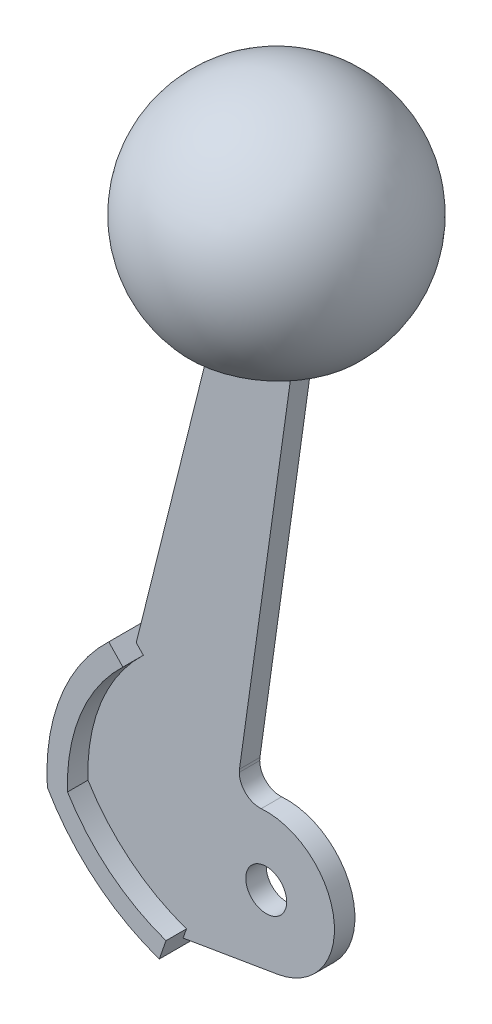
ISO-10303-21;
HEADER;
FILE_DESCRIPTION(('STEP AP214'),'2;1');
FILE_NAME('part.step','',(''),(''),'','','');
FILE_SCHEMA(('AUTOMOTIVE_DESIGN { 1 0 10303 214 1 1 1 1 }'));
ENDSEC;
DATA;
#1=APPLICATION_CONTEXT('core data for automotive mechanical design processes');
#2=APPLICATION_PROTOCOL_DEFINITION('international standard','automotive_design',2000,#1);
#3=PRODUCT_CONTEXT('',#1,'mechanical');
#4=PRODUCT('Part','Part','',(#3));
#5=PRODUCT_RELATED_PRODUCT_CATEGORY('part','',(#4));
#6=PRODUCT_DEFINITION_FORMATION('','',#4);
#7=PRODUCT_DEFINITION_CONTEXT('part definition',#1,'design');
#8=PRODUCT_DEFINITION('design','',#6,#7);
#9=PRODUCT_DEFINITION_SHAPE('','',#8);
#10=(LENGTH_UNIT() NAMED_UNIT(*) SI_UNIT(.MILLI.,.METRE.));
#11=(NAMED_UNIT(*) PLANE_ANGLE_UNIT() SI_UNIT($,.RADIAN.));
#12=(NAMED_UNIT(*) SI_UNIT($,.STERADIAN.) SOLID_ANGLE_UNIT());
#13=UNCERTAINTY_MEASURE_WITH_UNIT(LENGTH_MEASURE(1.E-05),#10,'distance_accuracy_value','');
#14=(GEOMETRIC_REPRESENTATION_CONTEXT(3) GLOBAL_UNCERTAINTY_ASSIGNED_CONTEXT((#13)) GLOBAL_UNIT_ASSIGNED_CONTEXT((#10,
#11,#12)) REPRESENTATION_CONTEXT('',''));
#15=CARTESIAN_POINT('',(0.,0.,0.));
#16=DIRECTION('',(0.,0.,1.));
#17=DIRECTION('',(1.,0.,0.));
#18=AXIS2_PLACEMENT_3D('',#15,#16,#17);
#19=CARTESIAN_POINT('',(-3.03211565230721E-07,1.84999999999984,4.5));
#20=DIRECTION('',(0.,0.,-1.));
#21=DIRECTION('',(-1.,0.,0.));
#22=AXIS2_PLACEMENT_3D('',#19,#20,#21);
#23=CYLINDRICAL_SURFACE('',#22,29.1499996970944);
#24=CARTESIAN_POINT('',(-2.35766267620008E-09,1.85,-4.5));
#25=DIRECTION('',(0.,0.,-1.));
#26=DIRECTION('',(-1.,0.,0.));
#27=AXIS2_PLACEMENT_3D('',#24,#25,#26);
#28=CIRCLE('',#27,29.1499999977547);
#29=CARTESIAN_POINT('',(-29.0910685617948,-0.00262784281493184,-4.5));
#30=VERTEX_POINT('',#29);
#31=CARTESIAN_POINT('',(-20.0853229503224,22.975868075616,-4.5));
#32=VERTEX_POINT('',#31);
#33=EDGE_CURVE('E209',#30,#32,#28,.T.);
#34=ORIENTED_EDGE('',*,*,#33,.F.);
#35=DIRECTION('',(0.,0.,1.));
#36=VECTOR('',#35,1.);
#37=CARTESIAN_POINT('',(-29.091068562,-0.002627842,0.));
#38=LINE('',#37,#36);
#39=CARTESIAN_POINT('',(-29.0910685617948,-0.00262784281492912,4.5));
#40=VERTEX_POINT('',#39);
#41=EDGE_CURVE('E221',#40,#30,#38,.F.);
#42=ORIENTED_EDGE('',*,*,#41,.F.);
#43=CARTESIAN_POINT('',(-3.03211565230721E-07,1.84999999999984,4.5));
#44=DIRECTION('',(0.,0.,-1.));
#45=DIRECTION('',(-1.,0.,0.));
#46=AXIS2_PLACEMENT_3D('',#43,#44,#45);
#47=CIRCLE('',#46,29.1499996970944);
#48=CARTESIAN_POINT('',(-20.0853229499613,22.9758680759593,4.5));
#49=VERTEX_POINT('',#48);
#50=EDGE_CURVE('E567',#49,#40,#47,.F.);
#51=ORIENTED_EDGE('',*,*,#50,.F.);
#52=DIRECTION('',(0.,0.,1.));
#53=VECTOR('',#52,1.);
#54=CARTESIAN_POINT('',(-20.08532295,22.975868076,0.));
#55=LINE('',#54,#53);
#56=EDGE_CURVE('E213',#32,#49,#55,.T.);
#57=ORIENTED_EDGE('',*,*,#56,.F.);
#58=EDGE_LOOP('',(#34,#42,#51,#57));
#59=FACE_BOUND('',#58,.T.);
#60=ADVANCED_FACE('F14',(#59),#23,.T.);
#61=CARTESIAN_POINT('',(-2.65000000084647,15.2000000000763,4.5));
#62=DIRECTION('',(0.,0.,-1.));
#63=DIRECTION('',(0.,1.,0.));
#64=AXIS2_PLACEMENT_3D('',#61,#62,#63);
#65=CYLINDRICAL_SURFACE('',#64,30.4999999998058);
#66=ORIENTED_EDGE('',*,*,#41,.T.);
#67=CARTESIAN_POINT('',(-2.65000000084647,15.2000000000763,-4.5));
#68=DIRECTION('',(0.,0.,-1.));
#69=DIRECTION('',(0.,1.,0.));
#70=AXIS2_PLACEMENT_3D('',#67,#68,#69);
#71=CIRCLE('',#70,30.4999999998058);
#72=CARTESIAN_POINT('',(-12.6802626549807,-13.603538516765,-4.5));
#73=VERTEX_POINT('',#72);
#74=EDGE_CURVE('E18',#73,#30,#71,.T.);
#75=ORIENTED_EDGE('',*,*,#74,.F.);
#76=DIRECTION('',(0.,0.,-1.));
#77=VECTOR('',#76,1.);
#78=CARTESIAN_POINT('',(-12.680262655,-13.603538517,0.));
#79=LINE('',#78,#77);
#80=CARTESIAN_POINT('',(-12.6802626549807,-13.603538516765,4.5));
#81=VERTEX_POINT('',#80);
#82=EDGE_CURVE('E204',#81,#73,#79,.T.);
#83=ORIENTED_EDGE('',*,*,#82,.F.);
#84=CARTESIAN_POINT('',(-2.65000000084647,15.2000000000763,4.5));
#85=DIRECTION('',(0.,0.,-1.));
#86=DIRECTION('',(0.,1.,0.));
#87=AXIS2_PLACEMENT_3D('',#84,#85,#86);
#88=CIRCLE('',#87,30.4999999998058);
#89=EDGE_CURVE('E196',#40,#81,#88,.F.);
#90=ORIENTED_EDGE('',*,*,#89,.F.);
#91=EDGE_LOOP('',(#66,#75,#83,#90));
#92=FACE_BOUND('',#91,.T.);
#93=ADVANCED_FACE('F516',(#92),#65,.T.);
#94=CARTESIAN_POINT('',(0.,85.,0.));
#95=DIRECTION('',(0.,0.,1.));
#96=DIRECTION('',(-1.,0.,0.));
#97=AXIS2_PLACEMENT_3D('',#94,#95,#96);
#98=SPHERICAL_SURFACE('',#97,17.5);
#99=CARTESIAN_POINT('',(0.,85.,0.));
#100=DIRECTION('',(0.0697564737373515,0.997564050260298,0.));
#101=DIRECTION('',(-0.997564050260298,0.0697564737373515,0.));
#102=AXIS2_PLACEMENT_3D('',#99,#100,#101);
#103=SPHERICAL_SURFACE('',#102,17.5);
#104=CARTESIAN_POINT('',(-0.822634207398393,73.2357827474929,0.));
#105=DIRECTION('',(0.0697564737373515,0.997564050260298,0.));
#106=DIRECTION('',(-0.997564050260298,0.0697564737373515,0.));
#107=AXIS2_PLACEMENT_3D('',#104,#105,#106);
#108=CIRCLE('',#107,12.929673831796);
#109=CARTESIAN_POINT('',(-13.7208120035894,74.1377112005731,0.));
#110=VERTEX_POINT('',#109);
#111=EDGE_CURVE('E187',#110,#110,#108,.F.);
#112=ORIENTED_EDGE('',*,*,#111,.F.);
#113=EDGE_LOOP('',(#112));
#114=FACE_BOUND('',#113,.T.);
#115=ADVANCED_FACE('F801',(#114),#103,.T.);
#116=CARTESIAN_POINT('',(-29.254737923,-13.823014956,-4.5));
#117=DIRECTION('',(0.,0.,1.));
#118=DIRECTION('',(1.,0.,0.));
#119=AXIS2_PLACEMENT_3D('',#116,#117,#118);
#120=PLANE('',#119);
#121=ORIENTED_EDGE('',*,*,#33,.T.);
#122=DIRECTION('',(-0.689033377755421,0.724729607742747,0.));
#123=VECTOR('',#122,1.);
#124=CARTESIAN_POINT('',(-19.051772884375,21.888773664,-4.5));
#125=LINE('',#124,#123);
#126=CARTESIAN_POINT('',(-18.0182228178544,20.8016792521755,-4.5));
#127=VERTEX_POINT('',#126);
#128=EDGE_CURVE('E149',#127,#32,#125,.T.);
#129=ORIENTED_EDGE('',*,*,#128,.F.);
#130=CARTESIAN_POINT('',(-2.83148504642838E-10,1.85,-4.5));
#131=DIRECTION('',(0.,0.,-1.));
#132=DIRECTION('',(-1.,0.,0.));
#133=AXIS2_PLACEMENT_3D('',#130,#131,#132);
#134=CIRCLE('',#133,26.1499999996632);
#135=CARTESIAN_POINT('',(-26.1323014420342,0.888063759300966,-4.49999999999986));
#136=VERTEX_POINT('',#135);
#137=EDGE_CURVE('E143',#136,#127,#134,.T.);
#138=ORIENTED_EDGE('',*,*,#137,.F.);
#139=CARTESIAN_POINT('',(-2.6499999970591,15.2000000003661,-4.5));
#140=DIRECTION('',(0.,0.,-1.));
#141=DIRECTION('',(0.,1.,0.));
#142=AXIS2_PLACEMENT_3D('',#139,#140,#141);
#143=CIRCLE('',#142,27.5000000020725);
#144=CARTESIAN_POINT('',(-11.6936794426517,-10.7704035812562,-4.5));
#145=VERTEX_POINT('',#144);
#146=EDGE_CURVE('E147',#145,#136,#143,.T.);
#147=ORIENTED_EDGE('',*,*,#146,.F.);
#148=DIRECTION('',(0.328861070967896,0.944378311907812,0.));
#149=VECTOR('',#148,1.);
#150=CARTESIAN_POINT('',(-12.186971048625,-12.186971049,-4.5));
#151=LINE('',#150,#149);
#152=EDGE_CURVE('E201',#73,#145,#151,.T.);
#153=ORIENTED_EDGE('',*,*,#152,.F.);
#154=ORIENTED_EDGE('',*,*,#74,.T.);
#155=EDGE_LOOP('',(#121,#129,#138,#147,#153,#154));
#156=FACE_BOUND('',#155,.T.);
#157=ADVANCED_FACE('F145',(#156),#120,.F.);
#158=CARTESIAN_POINT('',(-18.018222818,20.801679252,-4.5));
#159=DIRECTION('',(0.724729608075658,0.689033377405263,0.));
#160=DIRECTION('',(-0.689033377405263,0.724729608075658,0.));
#161=AXIS2_PLACEMENT_3D('',#158,#159,#160);
#162=PLANE('',#161);
#163=ORIENTED_EDGE('',*,*,#56,.T.);
#164=DIRECTION('',(-0.689033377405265,0.724729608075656,0.));
#165=VECTOR('',#164,1.);
#166=CARTESIAN_POINT('',(-18.018222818,20.801679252,4.5));
#167=LINE('',#166,#165);
#168=CARTESIAN_POINT('',(-18.0182228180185,20.8016792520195,4.5));
#169=VERTEX_POINT('',#168);
#170=EDGE_CURVE('E226',#169,#49,#167,.T.);
#171=ORIENTED_EDGE('',*,*,#170,.F.);
#172=DIRECTION('',(0.,0.,1.));
#173=VECTOR('',#172,1.);
#174=CARTESIAN_POINT('',(-18.018222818,20.801679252,3.));
#175=LINE('',#174,#173);
#176=CARTESIAN_POINT('',(-18.0182228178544,20.8016792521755,1.5));
#177=VERTEX_POINT('',#176);
#178=EDGE_CURVE('E491',#177,#169,#175,.T.);
#179=ORIENTED_EDGE('',*,*,#178,.F.);
#180=DIRECTION('',(-0.689033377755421,0.724729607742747,0.));
#181=VECTOR('',#180,1.);
#182=CARTESIAN_POINT('',(-19.051772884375,21.888773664,1.5));
#183=LINE('',#182,#181);
#184=CARTESIAN_POINT('',(-19.051772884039,21.8887736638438,1.5));
#185=VERTEX_POINT('',#184);
#186=EDGE_CURVE('E205',#177,#185,#183,.T.);
#187=ORIENTED_EDGE('',*,*,#186,.T.);
#188=DIRECTION('',(0.,0.,-1.));
#189=VECTOR('',#188,1.);
#190=CARTESIAN_POINT('',(-19.051772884,21.888773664,0.));
#191=LINE('',#190,#189);
#192=CARTESIAN_POINT('',(-19.051772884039,21.8887736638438,-1.5));
#193=VERTEX_POINT('',#192);
#194=EDGE_CURVE('E219',#193,#185,#191,.F.);
#195=ORIENTED_EDGE('',*,*,#194,.F.);
#196=DIRECTION('',(0.689033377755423,-0.724729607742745,0.));
#197=VECTOR('',#196,1.);
#198=CARTESIAN_POINT('',(-19.051772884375,21.888773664,-1.5));
#199=LINE('',#198,#197);
#200=CARTESIAN_POINT('',(-18.0182228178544,20.8016792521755,-1.5));
#201=VERTEX_POINT('',#200);
#202=EDGE_CURVE('E208',#193,#201,#199,.T.);
#203=ORIENTED_EDGE('',*,*,#202,.T.);
#204=DIRECTION('',(0.,0.,1.));
#205=VECTOR('',#204,1.);
#206=CARTESIAN_POINT('',(-18.018222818,20.801679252,-3.));
#207=LINE('',#206,#205);
#208=EDGE_CURVE('E154',#127,#201,#207,.T.);
#209=ORIENTED_EDGE('',*,*,#208,.F.);
#210=ORIENTED_EDGE('',*,*,#128,.T.);
#211=EDGE_LOOP('',(#163,#171,#179,#187,#195,#203,#209,#210));
#212=FACE_BOUND('',#211,.T.);
#213=ADVANCED_FACE('F572',(#212),#162,.T.);
#214=CARTESIAN_POINT('',(-29.254737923,-13.823014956,4.5));
#215=DIRECTION('',(0.,0.,1.));
#216=DIRECTION('',(1.,0.,0.));
#217=AXIS2_PLACEMENT_3D('',#214,#215,#216);
#218=PLANE('',#217);
#219=CARTESIAN_POINT('',(-2.6499999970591,15.2000000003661,4.5));
#220=DIRECTION('',(0.,0.,-1.));
#221=DIRECTION('',(0.,1.,0.));
#222=AXIS2_PLACEMENT_3D('',#219,#220,#221);
#223=CIRCLE('',#222,27.5000000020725);
#224=CARTESIAN_POINT('',(-26.1323014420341,0.888063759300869,4.5));
#225=VERTEX_POINT('',#224);
#226=CARTESIAN_POINT('',(-11.6936794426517,-10.7704035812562,4.5));
#227=VERTEX_POINT('',#226);
#228=EDGE_CURVE('E391',#225,#227,#223,.F.);
#229=ORIENTED_EDGE('',*,*,#228,.F.);
#230=CARTESIAN_POINT('',(-2.83148504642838E-10,1.85,4.5));
#231=DIRECTION('',(0.,0.,-1.));
#232=DIRECTION('',(-1.,0.,0.));
#233=AXIS2_PLACEMENT_3D('',#230,#231,#232);
#234=CIRCLE('',#233,26.1499999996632);
#235=EDGE_CURVE('E218',#169,#225,#234,.F.);
#236=ORIENTED_EDGE('',*,*,#235,.F.);
#237=ORIENTED_EDGE('',*,*,#170,.T.);
#238=ORIENTED_EDGE('',*,*,#50,.T.);
#239=ORIENTED_EDGE('',*,*,#89,.T.);
#240=DIRECTION('',(-0.328861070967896,-0.944378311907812,0.));
#241=VECTOR('',#240,1.);
#242=CARTESIAN_POINT('',(-12.186971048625,-12.186971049,4.5));
#243=LINE('',#242,#241);
#244=EDGE_CURVE('E195',#227,#81,#243,.T.);
#245=ORIENTED_EDGE('',*,*,#244,.F.);
#246=EDGE_LOOP('',(#229,#236,#237,#238,#239,#245));
#247=FACE_BOUND('',#246,.T.);
#248=ADVANCED_FACE('F510',(#247),#218,.T.);
#249=CARTESIAN_POINT('',(-12.680262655,-13.603538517,-4.5));
#250=DIRECTION('',(0.944378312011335,-0.328861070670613,0.));
#251=DIRECTION('',(0.328861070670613,0.944378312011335,0.));
#252=AXIS2_PLACEMENT_3D('',#249,#250,#251);
#253=PLANE('',#252);
#254=DIRECTION('',(0.,0.,-1.));
#255=VECTOR('',#254,1.);
#256=CARTESIAN_POINT('',(-11.693679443,-10.770403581,-3.));
#257=LINE('',#256,#255);
#258=CARTESIAN_POINT('',(-11.6936794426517,-10.7704035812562,-1.5));
#259=VERTEX_POINT('',#258);
#260=EDGE_CURVE('E164',#259,#145,#257,.T.);
#261=ORIENTED_EDGE('',*,*,#260,.F.);
#262=DIRECTION('',(-0.328861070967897,-0.944378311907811,0.));
#263=VECTOR('',#262,1.);
#264=CARTESIAN_POINT('',(-12.186971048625,-12.186971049,-1.5));
#265=LINE('',#264,#263);
#266=CARTESIAN_POINT('',(-12.1869710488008,-12.1869710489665,-1.5));
#267=VERTEX_POINT('',#266);
#268=EDGE_CURVE('E197',#259,#267,#265,.T.);
#269=ORIENTED_EDGE('',*,*,#268,.T.);
#270=DIRECTION('',(0.,0.,1.));
#271=VECTOR('',#270,1.);
#272=CARTESIAN_POINT('',(-12.186971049,-12.186971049,0.));
#273=LINE('',#272,#271);
#274=CARTESIAN_POINT('',(-12.1869710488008,-12.1869710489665,1.5));
#275=VERTEX_POINT('',#274);
#276=EDGE_CURVE('E484',#275,#267,#273,.F.);
#277=ORIENTED_EDGE('',*,*,#276,.F.);
#278=DIRECTION('',(0.328861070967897,0.944378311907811,0.));
#279=VECTOR('',#278,1.);
#280=CARTESIAN_POINT('',(-12.186971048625,-12.186971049,1.5));
#281=LINE('',#280,#279);
#282=CARTESIAN_POINT('',(-11.6936794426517,-10.7704035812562,1.5));
#283=VERTEX_POINT('',#282);
#284=EDGE_CURVE('E192',#275,#283,#281,.T.);
#285=ORIENTED_EDGE('',*,*,#284,.T.);
#286=DIRECTION('',(0.,0.,-1.));
#287=VECTOR('',#286,1.);
#288=CARTESIAN_POINT('',(-11.693679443,-10.770403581,3.));
#289=LINE('',#288,#287);
#290=EDGE_CURVE('E487',#227,#283,#289,.T.);
#291=ORIENTED_EDGE('',*,*,#290,.F.);
#292=ORIENTED_EDGE('',*,*,#244,.T.);
#293=ORIENTED_EDGE('',*,*,#82,.T.);
#294=ORIENTED_EDGE('',*,*,#152,.T.);
#295=EDGE_LOOP('',(#261,#269,#277,#285,#291,#292,#293,#294));
#296=FACE_BOUND('',#295,.T.);
#297=ADVANCED_FACE('F435',(#296),#253,.T.);
#298=CARTESIAN_POINT('',(-3.953676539,12.964972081,1.5));
#299=CARTESIAN_POINT('',(-3.953676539,12.964972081,0.5));
#300=CARTESIAN_POINT('',(-3.953676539,12.964972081,-0.5));
#301=CARTESIAN_POINT('',(-3.953676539,12.964972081,-1.5));
#302=CARTESIAN_POINT('',(-3.953676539,13.104711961,1.5));
#303=CARTESIAN_POINT('',(-3.953676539,13.104711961,0.5));
#304=CARTESIAN_POINT('',(-3.953676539,13.104711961,-0.5));
#305=CARTESIAN_POINT('',(-3.953676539,13.104711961,-1.5));
#306=CARTESIAN_POINT('',(-3.943928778,13.244111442,1.5));
#307=CARTESIAN_POINT('',(-3.943928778,13.244111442,0.5));
#308=CARTESIAN_POINT('',(-3.943928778,13.244111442,-0.5));
#309=CARTESIAN_POINT('',(-3.943928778,13.244111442,-1.5));
#310=CARTESIAN_POINT('',(-3.924480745,13.382491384,1.5));
#311=CARTESIAN_POINT('',(-3.924480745,13.382491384,0.5));
#312=CARTESIAN_POINT('',(-3.924480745,13.382491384,-0.5));
#313=CARTESIAN_POINT('',(-3.924480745,13.382491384,-1.5));
#314=(BOUNDED_SURFACE() B_SPLINE_SURFACE(3,3,((#298,#299,#300,#301),(#302,#303,#304,#305),(#306,
#307,#308,#309),(#310,#311,#312,#313)),.UNSPECIFIED.,.F.,.F.,
.F.) B_SPLINE_SURFACE_WITH_KNOTS((4,4),(4,4),(0.,1.),(0.,1.),
.UNSPECIFIED.) GEOMETRIC_REPRESENTATION_ITEM() RATIONAL_B_SPLINE_SURFACE(((1.,1.,1.,1.),
(0.998376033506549,0.998376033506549,0.998376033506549,0.998376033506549),(0.998376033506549,
0.998376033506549,0.998376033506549,0.998376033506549),(1.,1.,1.,1.))) REPRESENTATION_ITEM('') SURFACE());
#315=CARTESIAN_POINT('',(-3.953676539,12.9649720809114,-1.5));
#316=CARTESIAN_POINT('',(-3.95367691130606,12.9999150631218,-1.5));
#317=CARTESIAN_POINT('',(-3.95306612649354,13.034856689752,-1.5));
#318=CARTESIAN_POINT('',(-3.95062447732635,13.1046972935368,-1.5));
#319=CARTESIAN_POINT('',(-3.94879361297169,13.1395962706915,-1.5));
#320=CARTESIAN_POINT('',(-3.94148490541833,13.2440171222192,-1.5));
#321=CARTESIAN_POINT('',(-3.93419091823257,13.3134158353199,-1.5));
#322=CARTESIAN_POINT('',(-3.92448074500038,13.3824913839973,-1.5));
#323=B_SPLINE_CURVE_WITH_KNOTS('',3,(#315,#316,#317,#318,#319,#320,#321,#322),.UNSPECIFIED.,.F.,
.F.,(4,2,2,4),(0.,0.104820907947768,0.209641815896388,0.418825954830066),.UNSPECIFIED.);
#324=CARTESIAN_POINT('',(-3.953676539,12.9649720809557,-1.5));
#325=VERTEX_POINT('',#324);
#326=CARTESIAN_POINT('',(-3.92448074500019,13.3824913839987,-1.5));
#327=VERTEX_POINT('',#326);
#328=EDGE_CURVE('E420',#325,#327,#323,.T.);
#329=DIRECTION('',(0.,0.,-1.));
#330=VECTOR('',#329,1.);
#331=CARTESIAN_POINT('',(-3.924480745,13.382491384,0.));
#332=LINE('',#331,#330);
#333=CARTESIAN_POINT('',(-3.92448074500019,13.3824913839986,1.5));
#334=VERTEX_POINT('',#333);
#335=EDGE_CURVE('E390',#334,#327,#332,.T.);
#336=CARTESIAN_POINT('',(-3.92448074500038,13.3824913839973,1.5));
#337=CARTESIAN_POINT('',(-3.92934423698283,13.347888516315,1.5));
#338=CARTESIAN_POINT('',(-3.93360233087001,13.3132019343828,1.5));
#339=CARTESIAN_POINT('',(-3.94090437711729,13.2437012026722,1.5));
#340=CARTESIAN_POINT('',(-3.9439483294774,13.2088870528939,1.5));
#341=CARTESIAN_POINT('',(-3.95124332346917,13.1044652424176,1.5));
#342=CARTESIAN_POINT('',(-3.95367875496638,13.0347267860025,1.5));
#343=CARTESIAN_POINT('',(-3.953676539,12.9649720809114,1.5));
#344=B_SPLINE_CURVE_WITH_KNOTS('',3,(#336,#337,#338,#339,#340,#341,#342,#343),.UNSPECIFIED.,.F.,
.F.,(4,2,2,4),(0.,0.10482090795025,0.209641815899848,0.418825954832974),.UNSPECIFIED.);
#345=CARTESIAN_POINT('',(-3.953676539,12.9649720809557,1.5));
#346=VERTEX_POINT('',#345);
#347=EDGE_CURVE('E200',#334,#346,#344,.T.);
#348=DIRECTION('',(0.,0.,-1.));
#349=VECTOR('',#348,1.);
#350=CARTESIAN_POINT('',(-3.953676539,12.964972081,0.));
#351=LINE('',#350,#349);
#352=EDGE_CURVE('E476',#325,#346,#351,.F.);
#353=ORIENTED_EDGE('',*,*,#328,.T.);
#354=ORIENTED_EDGE('',*,*,#335,.F.);
#355=ORIENTED_EDGE('',*,*,#347,.T.);
#356=ORIENTED_EDGE('',*,*,#352,.F.);
#357=EDGE_LOOP('',(#353,#354,#355,#356));
#358=FACE_BOUND('',#357,.T.);
#359=ADVANCED_FACE('F400',(#358),#314,.F.);
#360=CARTESIAN_POINT('',(3.710741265,68.02185536,-0.656319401));
#361=CARTESIAN_POINT('',(3.696441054,67.817352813,-0.656319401));
#362=CARTESIAN_POINT('',(3.682140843,67.612850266,-0.656319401));
#363=CARTESIAN_POINT('',(3.667840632,67.408347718,-0.656319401));
#364=CARTESIAN_POINT('',(3.739491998,68.019844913,-0.438654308));
#365=CARTESIAN_POINT('',(3.725191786,67.815342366,-0.438654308));
#366=CARTESIAN_POINT('',(3.710891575,67.610839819,-0.438654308));
#367=CARTESIAN_POINT('',(3.696591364,67.406337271,-0.438654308));
#368=CARTESIAN_POINT('',(3.753898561,68.018837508,-0.219564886));
#369=CARTESIAN_POINT('',(3.73959835,67.8143349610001,-0.219564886));
#370=CARTESIAN_POINT('',(3.725298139,67.609832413,-0.219564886));
#371=CARTESIAN_POINT('',(3.710997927,67.405329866,-0.219564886));
#372=CARTESIAN_POINT('',(3.753898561,68.018837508,0.));
#373=CARTESIAN_POINT('',(3.73959835,67.814334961,0.));
#374=CARTESIAN_POINT('',(3.725298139,67.609832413,0.));
#375=CARTESIAN_POINT('',(3.710997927,67.405329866,0.));
#376=(BOUNDED_SURFACE() B_SPLINE_SURFACE(3,3,((#360,#361,#362,#363),(#364,#365,#366,#367),(#368,
#369,#370,#371),(#372,#373,#374,#375)),.UNSPECIFIED.,.F.,.F.,
.F.) B_SPLINE_SURFACE_WITH_KNOTS((4,4),(4,4),(0.,1.),(0.,1.),
.UNSPECIFIED.) GEOMETRIC_REPRESENTATION_ITEM() RATIONAL_B_SPLINE_SURFACE(((1.,1.,1.,1.),
(0.998556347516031,0.998556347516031,0.998556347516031,0.998556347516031),(0.998556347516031,
0.998556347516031,0.998556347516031,0.998556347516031),(1.,1.,1.,1.))) REPRESENTATION_ITEM('') SURFACE());
#377=DIRECTION('',(0.0697564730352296,0.997564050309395,0.));
#378=VECTOR('',#377,1.);
#379=CARTESIAN_POINT('',(3.732448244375,67.712083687,0.));
#380=LINE('',#379,#378);
#381=CARTESIAN_POINT('',(3.7109979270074,67.4053298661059,7.39393940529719E-11));
#382=VERTEX_POINT('',#381);
#383=CARTESIAN_POINT('',(3.75364269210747,68.0151784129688,0.));
#384=VERTEX_POINT('',#383);
#385=EDGE_CURVE('E188',#382,#384,#380,.T.);
#386=CARTESIAN_POINT('',(3.66835316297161,67.408311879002,-0.652427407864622));
#387=CARTESIAN_POINT('',(3.68253000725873,67.407320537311,-0.544388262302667));
#388=CARTESIAN_POINT('',(3.69317213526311,67.4065763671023,-0.436116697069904));
#389=CARTESIAN_POINT('',(3.7074174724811,67.4055802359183,-0.218642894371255));
#390=CARTESIAN_POINT('',(3.71099026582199,67.4053304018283,-0.10943865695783));
#391=CARTESIAN_POINT('',(3.71099792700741,67.405329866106,7.39393631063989E-11));
#392=B_SPLINE_CURVE_WITH_KNOTS('',3,(#386,#387,#388,#389,#390,#391),.UNSPECIFIED.,.F.,.F.,(4,2,
4),(0.,0.326387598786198,0.654176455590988),.UNSPECIFIED.);
#393=CARTESIAN_POINT('',(3.66835316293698,67.408311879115,-0.652427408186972));
#394=VERTEX_POINT('',#393);
#395=EDGE_CURVE('E191',#394,#382,#392,.T.);
#396=CARTESIAN_POINT('',(3.75364269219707,68.0151784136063,0.));
#397=CARTESIAN_POINT('',(3.75364326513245,68.0151824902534,-0.010824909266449));
#398=CARTESIAN_POINT('',(3.75357250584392,68.0146790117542,-0.0216435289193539));
#399=CARTESIAN_POINT('',(3.75329375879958,68.0126956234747,-0.0431746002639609));
#400=CARTESIAN_POINT('',(3.75308595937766,68.0112170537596,-0.0538871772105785));
#401=CARTESIAN_POINT('',(3.75227286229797,68.0054315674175,-0.085458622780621));
#402=CARTESIAN_POINT('',(3.75147751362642,67.9997723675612,-0.10607292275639));
#403=CARTESIAN_POINT('',(3.74913696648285,67.9831185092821,-0.152583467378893));
#404=CARTESIAN_POINT('',(3.7474331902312,67.9709955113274,-0.178056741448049));
#405=CARTESIAN_POINT('',(3.74348767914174,67.9429217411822,-0.22688466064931));
#406=CARTESIAN_POINT('',(3.74124253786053,67.9269467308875,-0.250224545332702));
#407=CARTESIAN_POINT('',(3.73658824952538,67.8938297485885,-0.292961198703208));
#408=CARTESIAN_POINT('',(3.73420805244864,67.8768937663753,-0.31252443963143));
#409=CARTESIAN_POINT('',(3.72922422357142,67.8414319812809,-0.350135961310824));
#410=CARTESIAN_POINT('',(3.72662038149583,67.8229046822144,-0.368182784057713));
#411=CARTESIAN_POINT('',(3.71855160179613,67.7654923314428,-0.420485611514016));
#412=CARTESIAN_POINT('',(3.71284298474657,67.7248734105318,-0.452789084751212));
#413=CARTESIAN_POINT('',(3.70077698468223,67.6390193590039,-0.515063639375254));
#414=CARTESIAN_POINT('',(3.69440161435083,67.593656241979,-0.544848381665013));
#415=CARTESIAN_POINT('',(3.68469538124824,67.5245928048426,-0.587007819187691));
#416=CARTESIAN_POINT('',(3.68146092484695,67.5015784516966,-0.600548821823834));
#417=CARTESIAN_POINT('',(3.6749423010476,67.4551960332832,-0.626963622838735));
#418=CARTESIAN_POINT('',(3.67165816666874,67.4318282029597,-0.639837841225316));
#419=CARTESIAN_POINT('',(3.66835316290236,67.4083118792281,-0.652427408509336));
#420=B_SPLINE_CURVE_WITH_KNOTS('',3,(#396,#397,#398,#399,#400,#401,#402,#403,#404,#405,#406,
#407,#408,#409,#410,#411,#412,#413,#414,#415,#416,#417,#418,#419),.UNSPECIFIED.,.F.,.F.,(4,2,2,
2,2,2,2,2,2,2,2,4),(0.,0.0324514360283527,0.0648583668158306,0.128721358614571,
0.213038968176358,0.297901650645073,0.375741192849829,0.453654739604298,0.609929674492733,
0.77370457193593,0.854388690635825,0.935021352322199),.UNSPECIFIED.);
#421=EDGE_CURVE('E383',#384,#394,#420,.T.);
#422=ORIENTED_EDGE('',*,*,#385,.F.);
#423=ORIENTED_EDGE('',*,*,#395,.F.);
#424=ORIENTED_EDGE('',*,*,#421,.F.);
#425=EDGE_LOOP('',(#422,#423,#424));
#426=FACE_BOUND('',#425,.T.);
#427=ADVANCED_FACE('F393',(#426),#376,.T.);
#428=CARTESIAN_POINT('',(3.668353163,67.408311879,-0.660256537));
#429=DIRECTION('',(-0.0697564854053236,-0.997564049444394,0.));
#430=DIRECTION('',(0.997564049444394,-0.0697564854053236,0.));
#431=AXIS2_PLACEMENT_3D('',#428,#429,#430);
#432=PLANE('',#431);
#433=CARTESIAN_POINT('',(3.66835316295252,67.4083118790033,0.652427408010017));
#434=CARTESIAN_POINT('',(3.68253000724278,67.4073205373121,0.544388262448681));
#435=CARTESIAN_POINT('',(3.69317213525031,67.4065763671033,0.436116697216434));
#436=CARTESIAN_POINT('',(3.70741747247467,67.4055802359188,0.218642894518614));
#437=CARTESIAN_POINT('',(3.71099026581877,67.4053304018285,0.109438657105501));
#438=CARTESIAN_POINT('',(3.7109979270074,67.4053298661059,7.39392895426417E-11));
#439=B_SPLINE_CURVE_WITH_KNOTS('',3,(#433,#434,#435,#436,#437,#438),.UNSPECIFIED.,.F.,.F.,(4,2,
4),(0.,0.326387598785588,0.65417645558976),.UNSPECIFIED.);
#440=CARTESIAN_POINT('',(3.66835316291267,67.4083118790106,0.652427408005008));
#441=VERTEX_POINT('',#440);
#442=EDGE_CURVE('E190',#441,#382,#439,.T.);
#443=ORIENTED_EDGE('',*,*,#442,.F.);
#444=DIRECTION('',(0.,0.,1.));
#445=VECTOR('',#444,1.);
#446=CARTESIAN_POINT('',(3.66835316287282,67.4083118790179,0.));
#447=LINE('',#446,#445);
#448=EDGE_CURVE('E389',#394,#441,#447,.T.);
#449=ORIENTED_EDGE('',*,*,#448,.F.);
#450=ORIENTED_EDGE('',*,*,#395,.T.);
#451=EDGE_LOOP('',(#443,#449,#450));
#452=FACE_BOUND('',#451,.T.);
#453=ADVANCED_FACE('F399',(#452),#432,.T.);
#454=CARTESIAN_POINT('',(3.753898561,68.018837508,0.));
#455=CARTESIAN_POINT('',(3.73959835,67.814334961,0.));
#456=CARTESIAN_POINT('',(3.725298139,67.609832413,0.));
#457=CARTESIAN_POINT('',(3.710997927,67.405329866,0.));
#458=CARTESIAN_POINT('',(3.753898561,68.018837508,0.219564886));
#459=CARTESIAN_POINT('',(3.73959835,67.8143349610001,0.219564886));
#460=CARTESIAN_POINT('',(3.725298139,67.609832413,0.219564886));
#461=CARTESIAN_POINT('',(3.710997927,67.405329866,0.219564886));
#462=CARTESIAN_POINT('',(3.739491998,68.019844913,0.438654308));
#463=CARTESIAN_POINT('',(3.725191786,67.815342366,0.438654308));
#464=CARTESIAN_POINT('',(3.710891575,67.610839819,0.438654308));
#465=CARTESIAN_POINT('',(3.696591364,67.406337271,0.438654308));
#466=CARTESIAN_POINT('',(3.710741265,68.02185536,0.656319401));
#467=CARTESIAN_POINT('',(3.696441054,67.817352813,0.656319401));
#468=CARTESIAN_POINT('',(3.682140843,67.612850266,0.656319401));
#469=CARTESIAN_POINT('',(3.667840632,67.408347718,0.656319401));
#470=(BOUNDED_SURFACE() B_SPLINE_SURFACE(3,3,((#454,#455,#456,#457),(#458,#459,#460,#461),(#462,
#463,#464,#465),(#466,#467,#468,#469)),.UNSPECIFIED.,.F.,.F.,
.F.) B_SPLINE_SURFACE_WITH_KNOTS((4,4),(4,4),(0.,1.),(0.,1.),
.UNSPECIFIED.) GEOMETRIC_REPRESENTATION_ITEM() RATIONAL_B_SPLINE_SURFACE(((1.,1.,1.,1.),
(0.998556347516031,0.998556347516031,0.998556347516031,0.998556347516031),(0.998556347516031,
0.998556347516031,0.998556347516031,0.998556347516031),(1.,1.,1.,1.))) REPRESENTATION_ITEM('') SURFACE());
#471=CARTESIAN_POINT('',(3.66835316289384,67.4083118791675,0.652427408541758));
#472=CARTESIAN_POINT('',(3.67146493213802,67.4304532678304,0.640574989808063));
#473=CARTESIAN_POINT('',(3.67455778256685,67.4524600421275,0.628470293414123));
#474=CARTESIAN_POINT('',(3.68069981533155,67.4961628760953,0.603675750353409));
#475=CARTESIAN_POINT('',(3.68374897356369,67.5178587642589,0.590985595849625));
#476=CARTESIAN_POINT('',(3.69299194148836,67.5836258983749,0.551182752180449));
#477=CARTESIAN_POINT('',(3.69910031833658,67.6270892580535,0.523013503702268));
#478=CARTESIAN_POINT('',(3.70876647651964,67.6958675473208,0.474111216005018));
#479=CARTESIAN_POINT('',(3.71243205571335,67.7219494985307,0.454481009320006));
#480=CARTESIAN_POINT('',(3.71957108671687,67.7727463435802,0.413411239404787));
#481=CARTESIAN_POINT('',(3.72304431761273,67.7974596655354,0.391969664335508));
#482=CARTESIAN_POINT('',(3.72966621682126,67.8445769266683,0.347173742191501));
#483=CARTESIAN_POINT('',(3.73281836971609,67.8670056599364,0.323846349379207));
#484=CARTESIAN_POINT('',(3.73870351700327,67.9088806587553,0.27464089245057));
#485=CARTESIAN_POINT('',(3.74143771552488,67.9283354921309,0.24877052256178));
#486=CARTESIAN_POINT('',(3.74560625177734,67.9579961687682,0.201632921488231));
#487=CARTESIAN_POINT('',(3.7471911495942,67.9692733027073,0.181062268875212));
#488=CARTESIAN_POINT('',(3.74990685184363,67.9885965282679,0.138463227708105));
#489=CARTESIAN_POINT('',(3.75103926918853,67.9966540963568,0.116440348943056));
#490=CARTESIAN_POINT('',(3.75245525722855,68.0067293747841,0.0786296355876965));
#491=CARTESIAN_POINT('',(3.75289511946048,68.0098591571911,0.0631435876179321));
#492=CARTESIAN_POINT('',(3.75349137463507,68.0141017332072,0.031781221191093));
#493=CARTESIAN_POINT('',(3.75364569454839,68.015199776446,0.0159028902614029));
#494=CARTESIAN_POINT('',(3.75364269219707,68.0151784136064,0.));
#495=B_SPLINE_CURVE_WITH_KNOTS('',3,(#471,#472,#473,#474,#475,#476,#477,#478,#479,#480,#481,
#482,#483,#484,#485,#486,#487,#488,#489,#490,#491,#492,#493,#494),.UNSPECIFIED.,.F.,.F.,(4,2,2,
2,2,2,2,2,2,2,2,4),(0.,0.07591180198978,0.1518639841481,0.308158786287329,0.406649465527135,
0.505251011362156,0.602632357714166,0.699727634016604,0.770061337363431,0.840142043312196,
0.88742910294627,0.935058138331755),.UNSPECIFIED.);
#496=EDGE_CURVE('E377',#441,#384,#495,.T.);
#497=ORIENTED_EDGE('',*,*,#496,.F.);
#498=ORIENTED_EDGE('',*,*,#442,.T.);
#499=ORIENTED_EDGE('',*,*,#385,.T.);
#500=EDGE_LOOP('',(#497,#498,#499));
#501=FACE_BOUND('',#500,.T.);
#502=ADVANCED_FACE('F332',(#501),#470,.T.);
#503=CARTESIAN_POINT('',(12.230321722,72.323031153,-13.084829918));
#504=DIRECTION('',(0.0697564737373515,0.997564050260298,0.));
#505=DIRECTION('',(-0.997564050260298,0.0697564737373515,0.));
#506=AXIS2_PLACEMENT_3D('',#503,#504,#505);
#507=PLANE('',#506);
#508=DIRECTION('',(0.997564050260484,-0.0697564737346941,0.));
#509=VECTOR('',#508,1.);
#510=CARTESIAN_POINT('',(-0.822634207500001,73.2357827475,-1.5));
#511=LINE('',#510,#509);
#512=CARTESIAN_POINT('',(-5.65123898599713,73.5734316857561,-1.5000000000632));
#513=VERTEX_POINT('',#512);
#514=CARTESIAN_POINT('',(-6.16226739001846,73.6091662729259,-1.5));
#515=VERTEX_POINT('',#514);
#516=EDGE_CURVE('E176',#513,#515,#511,.F.);
#517=ORIENTED_EDGE('',*,*,#516,.T.);
#518=DIRECTION('',(0.,0.,1.));
#519=VECTOR('',#518,1.);
#520=CARTESIAN_POINT('',(-6.16226739,73.609166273,0.));
#521=LINE('',#520,#519);
#522=CARTESIAN_POINT('',(-6.16226739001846,73.6091662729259,1.5));
#523=VERTEX_POINT('',#522);
#524=EDGE_CURVE('E215',#523,#515,#521,.F.);
#525=ORIENTED_EDGE('',*,*,#524,.F.);
#526=DIRECTION('',(-0.997564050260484,0.0697564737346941,0.));
#527=VECTOR('',#526,1.);
#528=CARTESIAN_POINT('',(-0.822634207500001,73.2357827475,1.5));
#529=LINE('',#528,#527);
#530=CARTESIAN_POINT('',(-5.65123898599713,73.5734316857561,1.5000000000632));
#531=VERTEX_POINT('',#530);
#532=EDGE_CURVE('E185',#523,#531,#529,.F.);
#533=ORIENTED_EDGE('',*,*,#532,.T.);
#534=CARTESIAN_POINT('',(3.86491554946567,72.9079973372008,1.49999999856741));
#535=CARTESIAN_POINT('',(3.82284477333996,72.910939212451,1.6341536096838));
#536=CARTESIAN_POINT('',(3.77510078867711,72.9142777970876,1.76651644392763));
#537=CARTESIAN_POINT('',(3.66867010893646,72.9217201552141,2.02673774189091));
#538=CARTESIAN_POINT('',(3.60998393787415,72.9258238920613,2.15459642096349));
#539=CARTESIAN_POINT('',(3.4821133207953,72.934765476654,2.40481188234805));
#540=CARTESIAN_POINT('',(3.41293626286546,72.9396028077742,2.52717245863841));
#541=CARTESIAN_POINT('',(3.2645505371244,72.9499789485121,2.76561821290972));
#542=CARTESIAN_POINT('',(3.18534199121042,72.955517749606,2.88170346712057));
#543=CARTESIAN_POINT('',(3.01743012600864,72.967259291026,3.10680721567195));
#544=CARTESIAN_POINT('',(2.92872409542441,72.9734622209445,3.21582367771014));
#545=CARTESIAN_POINT('',(2.74243226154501,72.9864890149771,3.42601763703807));
#546=CARTESIAN_POINT('',(2.64484318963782,72.9933131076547,3.52719222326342));
#547=CARTESIAN_POINT('',(2.44156506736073,73.0075276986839,3.72088297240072));
#548=CARTESIAN_POINT('',(2.33588064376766,73.0149178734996,3.81340401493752));
#549=CARTESIAN_POINT('',(2.11707381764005,73.0302183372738,3.98922758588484));
#550=CARTESIAN_POINT('',(2.00394868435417,73.0381288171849,4.07252669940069));
#551=CARTESIAN_POINT('',(1.77114035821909,73.0544083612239,4.22924747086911));
#552=CARTESIAN_POINT('',(1.65145945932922,73.0627772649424,4.30267255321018));
#553=CARTESIAN_POINT('',(1.40630872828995,73.0799198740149,4.43918291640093));
#554=CARTESIAN_POINT('',(1.28083677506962,73.0886937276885,4.5022643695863));
#555=CARTESIAN_POINT('',(1.02506452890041,73.1065790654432,4.61759370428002));
#556=CARTESIAN_POINT('',(0.8947652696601,73.1156904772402,4.66984388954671));
#557=CARTESIAN_POINT('',(0.630190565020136,73.1341913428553,4.76317341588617));
#558=CARTESIAN_POINT('',(0.495913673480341,73.1435808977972,4.80424863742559));
#559=CARTESIAN_POINT('',(0.224439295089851,73.1625642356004,4.87489641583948));
#560=CARTESIAN_POINT('',(0.0872430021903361,73.1721579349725,4.90447358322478));
#561=CARTESIAN_POINT('',(-0.189195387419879,73.1914883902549,4.9519467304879));
#562=CARTESIAN_POINT('',(-0.328438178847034,73.2012251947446,4.96983864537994));
#563=CARTESIAN_POINT('',(-0.607898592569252,73.2207669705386,4.99379472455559));
#564=CARTESIAN_POINT('',(-0.748115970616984,73.2305719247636,4.99986175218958));
#565=CARTESIAN_POINT('',(-1.02856216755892,73.2501826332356,5.0001335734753));
#566=CARTESIAN_POINT('',(-1.16879098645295,73.2599883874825,4.99433836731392));
#567=CARTESIAN_POINT('',(-1.44829155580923,73.2795329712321,4.97092452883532));
#568=CARTESIAN_POINT('',(-1.58756310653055,73.2892717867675,4.95330350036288));
#569=CARTESIAN_POINT('',(-1.8640817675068,73.3086078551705,4.90636909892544));
#570=CARTESIAN_POINT('',(-2.00132956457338,73.3182051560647,4.87705979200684));
#571=CARTESIAN_POINT('',(-2.27292495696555,73.3371969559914,4.80694414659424));
#572=CARTESIAN_POINT('',(-2.40727146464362,73.3465913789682,4.76613357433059));
#573=CARTESIAN_POINT('',(-2.67200769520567,73.3651035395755,4.67332722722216));
#574=CARTESIAN_POINT('',(-2.80239885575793,73.3742213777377,4.6213355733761));
#575=CARTESIAN_POINT('',(-3.05838674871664,73.3921217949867,4.50651093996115));
#576=CARTESIAN_POINT('',(-3.18398207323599,73.4009042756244,4.44367480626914));
#577=CARTESIAN_POINT('',(-3.42939964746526,73.4180655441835,4.30764363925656));
#578=CARTESIAN_POINT('',(-3.54922401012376,73.4264444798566,4.23445243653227));
#579=CARTESIAN_POINT('',(-3.78235766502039,73.4427467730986,4.07817359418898));
#580=CARTESIAN_POINT('',(-3.89566358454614,73.4506698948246,3.99508089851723));
#581=CARTESIAN_POINT('',(-4.11484728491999,73.4659967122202,3.81965256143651));
#582=CARTESIAN_POINT('',(-4.22072779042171,73.4734005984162,3.72732034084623));
#583=CARTESIAN_POINT('',(-4.42443086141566,73.4876449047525,3.53397069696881));
#584=CARTESIAN_POINT('',(-4.52224729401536,73.4944848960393,3.43294678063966));
#585=CARTESIAN_POINT('',(-4.70900233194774,73.507544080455,3.22303171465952));
#586=CARTESIAN_POINT('',(-4.79794420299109,73.5137635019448,3.11414348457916));
#587=CARTESIAN_POINT('',(-4.9663116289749,73.5255368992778,2.88930337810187));
#588=CARTESIAN_POINT('',(-5.04574242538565,73.5310912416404,2.7733554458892));
#589=CARTESIAN_POINT('',(-5.19455558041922,73.5414972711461,2.53520786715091));
#590=CARTESIAN_POINT('',(-5.26394142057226,73.5463492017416,2.41301040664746));
#591=CARTESIAN_POINT('',(-5.39303780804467,73.5553765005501,2.16156071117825));
#592=CARTESIAN_POINT('',(-5.45261031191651,73.5595422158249,2.03223723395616));
#593=CARTESIAN_POINT('',(-5.5604515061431,73.5670832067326,1.76921253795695));
#594=CARTESIAN_POINT('',(-5.60874049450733,73.5704599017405,1.63551968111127));
#595=CARTESIAN_POINT('',(-5.65123898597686,73.5734316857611,1.50000000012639));
#596=B_SPLINE_CURVE_WITH_KNOTS('',3,(#534,#535,#536,#537,#538,#539,#540,#541,#542,#543,#544,
#545,#546,#547,#548,#549,#550,#551,#552,#553,#554,#555,#556,#557,#558,#559,#560,#561,#562,#563,
#564,#565,#566,#567,#568,#569,#570,#571,#572,#573,#574,#575,#576,#577,#578,#579,#580,#581,#582,
#583,#584,#585,#586,#587,#588,#589,#590,#591,#592,#593,#594,#595),.UNSPECIFIED.,.F.,.F.,(4,2,2,
2,2,2,2,2,2,2,2,2,2,2,2,2,2,2,2,2,2,2,2,2,2,2,2,2,2,2,4),(0.,0.421750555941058,
0.843480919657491,1.26491565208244,1.68634526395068,2.10789550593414,2.52960149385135,
2.95106823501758,3.37269052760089,3.79416621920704,4.21579752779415,4.63733906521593,
5.05903578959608,5.48056324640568,5.90223726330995,6.32380916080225,6.74538105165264,
7.16703838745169,7.58854916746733,8.01021531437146,8.4317263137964,8.85336011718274,
9.27483835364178,9.6965327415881,10.1180715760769,10.5399280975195,10.9616288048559,
11.383096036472,11.8044168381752,12.2312345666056,12.6572784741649),.UNSPECIFIED.);
#597=CARTESIAN_POINT('',(3.86491554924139,72.9079973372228,1.49999999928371));
#598=VERTEX_POINT('',#597);
#599=EDGE_CURVE('E452',#598,#531,#596,.T.);
#600=ORIENTED_EDGE('',*,*,#599,.F.);
#601=DIRECTION('',(-0.997564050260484,0.0697564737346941,0.));
#602=VECTOR('',#601,1.);
#603=CARTESIAN_POINT('',(-0.822634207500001,73.2357827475,1.5));
#604=LINE('',#603,#602);
#605=CARTESIAN_POINT('',(4.43567437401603,72.8680859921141,1.5));
#606=VERTEX_POINT('',#605);
#607=EDGE_CURVE('E182',#598,#606,#604,.F.);
#608=ORIENTED_EDGE('',*,*,#607,.T.);
#609=DIRECTION('',(0.,0.,1.));
#610=VECTOR('',#609,1.);
#611=CARTESIAN_POINT('',(4.435674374,72.868085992,0.));
#612=LINE('',#611,#610);
#613=CARTESIAN_POINT('',(4.43567437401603,72.8680859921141,-1.5));
#614=VERTEX_POINT('',#613);
#615=EDGE_CURVE('E472',#614,#606,#612,.T.);
#616=ORIENTED_EDGE('',*,*,#615,.F.);
#617=DIRECTION('',(0.997564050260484,-0.0697564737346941,0.));
#618=VECTOR('',#617,1.);
#619=CARTESIAN_POINT('',(-0.822634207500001,73.2357827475,-1.5));
#620=LINE('',#619,#618);
#621=CARTESIAN_POINT('',(3.86491554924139,72.9079973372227,-1.49999999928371));
#622=VERTEX_POINT('',#621);
#623=EDGE_CURVE('E180',#614,#622,#620,.F.);
#624=ORIENTED_EDGE('',*,*,#623,.T.);
#625=CARTESIAN_POINT('',(-5.65123898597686,73.5734316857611,-1.50000000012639));
#626=CARTESIAN_POINT('',(-5.60916820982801,73.5704898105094,-1.63415361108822));
#627=CARTESIAN_POINT('',(-5.56142422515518,73.567151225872,-1.76651644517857));
#628=CARTESIAN_POINT('',(-5.45499354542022,73.5597088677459,-2.02673774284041));
#629=CARTESIAN_POINT('',(-5.39630737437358,73.5556051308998,-2.15459642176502));
#630=CARTESIAN_POINT('',(-5.26843675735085,73.5466635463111,-2.4048118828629));
#631=CARTESIAN_POINT('',(-5.19925969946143,73.5418262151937,-2.52717245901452));
#632=CARTESIAN_POINT('',(-5.05087397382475,73.531450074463,-2.7656182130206));
#633=CARTESIAN_POINT('',(-4.97166542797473,73.5259112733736,-2.88170346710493));
#634=CARTESIAN_POINT('',(-4.80375356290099,73.5141697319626,-3.10680721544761));
#635=CARTESIAN_POINT('',(-4.7150475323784,73.5079668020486,-3.21582367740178));
#636=CARTESIAN_POINT('',(-4.52875569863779,73.4949400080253,-3.42601763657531));
#637=CARTESIAN_POINT('',(-4.43116662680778,73.4881159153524,-3.52719222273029));
#638=CARTESIAN_POINT('',(-4.22788850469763,73.4739013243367,-3.72088297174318));
#639=CARTESIAN_POINT('',(-4.12220408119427,73.4665111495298,-3.81340401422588));
#640=CARTESIAN_POINT('',(-3.90339725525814,73.4512106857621,-3.98922758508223));
#641=CARTESIAN_POINT('',(-3.79027212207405,73.4433002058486,-4.07252669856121));
#642=CARTESIAN_POINT('',(-3.55746379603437,73.4270206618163,-4.22924747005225));
#643=CARTESIAN_POINT('',(-3.43778289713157,73.4186517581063,-4.30267255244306));
#644=CARTESIAN_POINT('',(-3.19263216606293,73.4015091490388,-4.43918291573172));
#645=CARTESIAN_POINT('',(-3.06716021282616,73.3927352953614,-4.50226436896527));
#646=CARTESIAN_POINT('',(-2.81138796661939,73.3748499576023,-4.61759370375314));
#647=CARTESIAN_POINT('',(-2.68108870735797,73.3657385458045,-4.6698438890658));
#648=CARTESIAN_POINT('',(-2.41651400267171,73.3472376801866,-4.76317341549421));
#649=CARTESIAN_POINT('',(-2.28223711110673,73.3378481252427,-4.80424863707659));
#650=CARTESIAN_POINT('',(-2.01076273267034,73.3188647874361,-4.87489641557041));
#651=CARTESIAN_POINT('',(-1.87356643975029,73.3092710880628,-4.90447358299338));
#652=CARTESIAN_POINT('',(-1.59712805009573,73.2899406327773,-4.95194673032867));
#653=CARTESIAN_POINT('',(-1.45788525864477,73.280203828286,-4.96983864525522));
#654=CARTESIAN_POINT('',(-1.17842484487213,73.2606620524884,-4.99379472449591));
#655=CARTESIAN_POINT('',(-1.03820746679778,73.2508570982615,-4.99986175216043));
#656=CARTESIAN_POINT('',(-0.757761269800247,73.2312463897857,-5.00013357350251));
#657=CARTESIAN_POINT('',(-0.617532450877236,73.2214406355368,-4.99433836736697));
#658=CARTESIAN_POINT('',(-0.338031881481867,73.2018960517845,-4.97092452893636));
#659=CARTESIAN_POINT('',(-0.198760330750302,73.1921572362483,-4.95330350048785));
#660=CARTESIAN_POINT('',(0.0777583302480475,73.1728211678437,-4.90636909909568));
#661=CARTESIAN_POINT('',(0.215006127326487,73.1632238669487,-4.87705979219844));
#662=CARTESIAN_POINT('',(0.486601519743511,73.1442320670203,-4.80694414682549));
#663=CARTESIAN_POINT('',(0.620948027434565,73.1348376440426,-4.76613357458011));
#664=CARTESIAN_POINT('',(0.885684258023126,73.1163254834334,-4.6733272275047));
#665=CARTESIAN_POINT('',(1.0160754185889,73.1072076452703,-4.62133557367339));
#666=CARTESIAN_POINT('',(1.27206331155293,73.0893072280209,-4.50651094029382));
#667=CARTESIAN_POINT('',(1.39765863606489,73.0805247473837,-4.44367480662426));
#668=CARTESIAN_POINT('',(1.64307621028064,73.0633634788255,-4.30764363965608));
#669=CARTESIAN_POINT('',(1.762900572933,73.0549845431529,-4.23445243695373));
#670=CARTESIAN_POINT('',(1.99603422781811,73.0386822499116,-4.07817359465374));
#671=CARTESIAN_POINT('',(2.1093401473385,73.030759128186,-3.99508089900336));
#672=CARTESIAN_POINT('',(2.32852384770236,73.0154323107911,-3.81965256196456));
#673=CARTESIAN_POINT('',(2.43440435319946,73.0080284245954,-3.7273203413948));
#674=CARTESIAN_POINT('',(2.63810742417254,72.9937841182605,-3.53397069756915));
#675=CARTESIAN_POINT('',(2.73592385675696,72.9869441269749,-3.43294678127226));
#676=CARTESIAN_POINT('',(2.92267889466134,72.9738849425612,-3.22303171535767));
#677=CARTESIAN_POINT('',(3.01162076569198,72.9676655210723,-3.11414348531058));
#678=CARTESIAN_POINT('',(3.17998819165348,72.9558921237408,-2.88930337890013));
#679=CARTESIAN_POINT('',(3.25941898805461,72.9503377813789,-2.77335544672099));
#680=CARTESIAN_POINT('',(3.4082321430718,72.9399317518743,-2.5352078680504));
#681=CARTESIAN_POINT('',(3.47761798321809,72.9350798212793,-2.41301040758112));
#682=CARTESIAN_POINT('',(3.60671437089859,72.9260525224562,-2.16156071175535));
#683=CARTESIAN_POINT('',(3.66628687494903,72.9218868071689,-2.03223723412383));
#684=CARTESIAN_POINT('',(3.77412806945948,72.9143458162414,-1.76921253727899));
#685=CARTESIAN_POINT('',(3.82241705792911,72.9109691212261,-1.63551967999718));
#686=CARTESIAN_POINT('',(3.86491554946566,72.9079973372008,-1.49999999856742));
#687=B_SPLINE_CURVE_WITH_KNOTS('',3,(#625,#626,#627,#628,#629,#630,#631,#632,#633,#634,#635,
#636,#637,#638,#639,#640,#641,#642,#643,#644,#645,#646,#647,#648,#649,#650,#651,#652,#653,#654,
#655,#656,#657,#658,#659,#660,#661,#662,#663,#664,#665,#666,#667,#668,#669,#670,#671,#672,#673,
#674,#675,#676,#677,#678,#679,#680,#681,#682,#683,#684,#685,#686),.UNSPECIFIED.,.F.,.F.,(4,2,2,
2,2,2,2,2,2,2,2,2,2,2,2,2,2,2,2,2,2,2,2,2,2,2,2,2,2,2,4),(0.,0.421750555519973,
0.843480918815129,1.26491565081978,1.68634526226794,2.10789550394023,2.52960149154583,
2.95106823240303,3.37269052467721,3.79416621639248,4.2157975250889,4.63733906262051,
5.05903578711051,5.48056324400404,5.90223726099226,6.3238091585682,6.74538104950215,
7.16703838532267,7.58854916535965,8.01021531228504,8.43172631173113,8.85336011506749,
9.27483835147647,9.69653273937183,10.1180715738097,10.5399280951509,10.9616288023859,
11.3830960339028,11.8044168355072,12.2312345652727,12.6572784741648),.UNSPECIFIED.);
#688=EDGE_CURVE('E175',#513,#622,#687,.T.);
#689=ORIENTED_EDGE('',*,*,#688,.F.);
#690=EDGE_LOOP('',(#517,#525,#533,#600,#608,#616,#624,#689));
#691=FACE_BOUND('',#690,.T.);
#692=ORIENTED_EDGE('',*,*,#111,.T.);
#693=EDGE_LOOP('',(#692));
#694=FACE_BOUND('',#693,.T.);
#695=ADVANCED_FACE('F437',(#691,#694),#507,.F.);
#696=CARTESIAN_POINT('',(-2.612311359,67.847498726,-2.003));
#697=DIRECTION('',(-0.069756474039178,-0.997564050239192,0.));
#698=DIRECTION('',(0.997564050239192,-0.069756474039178,0.));
#699=AXIS2_PLACEMENT_3D('',#696,#697,#698);
#700=PLANE('',#699);
#701=DIRECTION('',(0.997564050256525,-0.0697564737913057,0.));
#702=VECTOR('',#701,1.);
#703=CARTESIAN_POINT('',(-2.596475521,67.846391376,-1.5));
#704=LINE('',#703,#702);
#705=CARTESIAN_POINT('',(-2.5964755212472,67.846391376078,-1.50000000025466));
#706=VERTEX_POINT('',#705);
#707=CARTESIAN_POINT('',(0.0428308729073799,67.6618330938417,-1.49999999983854));
#708=VERTEX_POINT('',#707);
#709=EDGE_CURVE('E322',#706,#708,#704,.T.);
#710=ORIENTED_EDGE('',*,*,#709,.F.);
#711=CARTESIAN_POINT('',(0.0428308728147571,67.6618330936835,-1.49999999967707));
#712=CARTESIAN_POINT('',(0.000732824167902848,67.6647768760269,-1.53721714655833));
#713=CARTESIAN_POINT('',(-0.0429123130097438,67.6678288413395,-1.5726350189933));
#714=CARTESIAN_POINT('',(-0.133019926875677,67.6741297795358,-1.63966001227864));
#715=CARTESIAN_POINT('',(-0.179482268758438,67.6773787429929,-1.6712673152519));
#716=CARTESIAN_POINT('',(-0.322535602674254,67.687382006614,-1.75996683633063));
#717=CARTESIAN_POINT('',(-0.422927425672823,67.6944020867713,-1.81105535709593));
#718=CARTESIAN_POINT('',(-0.630840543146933,67.7089407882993,-1.89561023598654));
#719=CARTESIAN_POINT('',(-0.738365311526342,67.716459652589,-1.929067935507));
#720=CARTESIAN_POINT('',(-0.957476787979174,67.7317814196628,-1.97741088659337));
#721=CARTESIAN_POINT('',(-1.06906239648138,67.7395842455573,-1.99230112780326));
#722=CARTESIAN_POINT('',(-1.29312563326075,67.7552522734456,-2.00309186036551));
#723=CARTESIAN_POINT('',(-1.40560315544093,67.7631174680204,-1.99899457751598));
#724=CARTESIAN_POINT('',(-1.62833821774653,67.7786926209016,-1.97192308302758));
#725=CARTESIAN_POINT('',(-1.73859461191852,67.7864024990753,-1.94893937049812));
#726=CARTESIAN_POINT('',(-1.95373863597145,67.80144683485,-1.88473356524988));
#727=CARTESIAN_POINT('',(-2.05862302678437,67.8087810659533,-1.84350061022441));
#728=CARTESIAN_POINT('',(-2.25988160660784,67.8228544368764,-1.74398305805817));
#729=CARTESIAN_POINT('',(-2.35626991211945,67.8295945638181,-1.68572746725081));
#730=CARTESIAN_POINT('',(-2.47286379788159,67.8377476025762,-1.60110034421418));
#731=CARTESIAN_POINT('',(-2.49828270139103,67.8395250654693,-1.58169775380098));
#732=CARTESIAN_POINT('',(-2.54812354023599,67.8430102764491,-1.54172270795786));
#733=CARTESIAN_POINT('',(-2.57254695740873,67.8447181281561,-1.52115210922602));
#734=CARTESIAN_POINT('',(-2.5964755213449,67.8463913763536,-1.50000000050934));
#735=B_SPLINE_CURVE_WITH_KNOTS('',3,(#711,#712,#713,#714,#715,#716,#717,#718,#719,#720,#721,
#722,#723,#724,#725,#726,#727,#728,#729,#730,#731,#732,#733,#734),.UNSPECIFIED.,.F.,.F.,(4,2,2,
2,2,2,2,2,2,2,2,4),(0.,0.168698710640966,0.337389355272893,0.674238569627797,1.01125305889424,
1.34817696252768,1.6850613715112,2.02211535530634,2.35937023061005,2.69605374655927,
2.79211118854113,2.88801999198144),.UNSPECIFIED.);
#736=EDGE_CURVE('E179',#708,#706,#735,.T.);
#737=ORIENTED_EDGE('',*,*,#736,.F.);
#738=EDGE_LOOP('',(#710,#737));
#739=FACE_BOUND('',#738,.T.);
#740=ADVANCED_FACE('F330',(#739),#700,.T.);
#741=CARTESIAN_POINT('',(3.712708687,70.412535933,-1.42736251));
#742=CARTESIAN_POINT('',(1.975368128,70.5340226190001,-7.27419641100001));
#743=CARTESIAN_POINT('',(-4.110473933,70.959586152,-7.27419641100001));
#744=CARTESIAN_POINT('',(-5.847814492,71.081072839,-1.42736251));
#745=CARTESIAN_POINT('',(2.686899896,69.481825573,-1.141890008));
#746=CARTESIAN_POINT('',(1.297027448,69.579014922,-5.819357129));
#747=CARTESIAN_POINT('',(-3.571646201,69.919465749,-5.819357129));
#748=CARTESIAN_POINT('',(-4.961518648,70.016655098,-1.141890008));
#749=CARTESIAN_POINT('',(1.661091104,68.551115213,-0.856417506));
#750=CARTESIAN_POINT('',(0.618686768,68.6240072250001,-4.364517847));
#751=CARTESIAN_POINT('',(-3.032818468,68.879345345,-4.364517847));
#752=CARTESIAN_POINT('',(-4.075222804,68.952237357,-0.856417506));
#753=CARTESIAN_POINT('',(0.635282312,67.620404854,-0.570945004));
#754=CARTESIAN_POINT('',(-0.059653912,67.668999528,-2.909678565));
#755=CARTESIAN_POINT('',(-2.493990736,67.839224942,-2.909678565));
#756=CARTESIAN_POINT('',(-3.18892696,67.887819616,-0.570945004));
#757=(BOUNDED_SURFACE() B_SPLINE_SURFACE(3,3,((#741,#742,#743,#744),(#745,#746,#747,#748),(#749,
#750,#751,#752),(#753,#754,#755,#756)),.UNSPECIFIED.,.F.,.F.,
.F.) B_SPLINE_SURFACE_WITH_KNOTS((4,4),(4,4),(0.,1.),(0.,1.),
.UNSPECIFIED.) GEOMETRIC_REPRESENTATION_ITEM() RATIONAL_B_SPLINE_SURFACE(((1.,0.523648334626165,
0.523648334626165,1.),(1.,0.523648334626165,0.523648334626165,1.),(1.,0.523648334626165,
0.523648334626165,1.),(1.,0.523648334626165,0.523648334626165,1.))) REPRESENTATION_ITEM('') SURFACE());
#758=CARTESIAN_POINT('',(0.0428308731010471,67.6618330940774,-1.5));
#759=CARTESIAN_POINT('',(0.0943556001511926,67.6909769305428,-1.5));
#760=CARTESIAN_POINT('',(0.145463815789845,67.7208428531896,-1.5));
#761=CARTESIAN_POINT('',(0.2469461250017,67.7817785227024,-1.5));
#762=CARTESIAN_POINT('',(0.297320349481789,67.8128480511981,-1.5));
#763=CARTESIAN_POINT('',(0.397422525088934,67.875942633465,-1.5));
#764=CARTESIAN_POINT('',(0.447150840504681,67.907967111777,-1.5));
#765=CARTESIAN_POINT('',(0.546079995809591,67.9728247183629,-1.5));
#766=CARTESIAN_POINT('',(0.595280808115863,68.0056578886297,-1.5));
#767=CARTESIAN_POINT('',(0.742079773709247,68.1050751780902,-1.5));
#768=CARTESIAN_POINT('',(0.839001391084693,68.1726580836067,-1.5));
#769=CARTESIAN_POINT('',(1.03150415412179,68.3097302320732,-1.5));
#770=CARTESIAN_POINT('',(1.12708505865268,68.3792198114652,-1.5));
#771=CARTESIAN_POINT('',(1.31695844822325,68.5194190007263,-1.5));
#772=CARTESIAN_POINT('',(1.41125365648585,68.5901249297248,-1.5));
#773=CARTESIAN_POINT('',(1.59902980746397,68.7325949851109,-1.5));
#774=CARTESIAN_POINT('',(1.69251080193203,68.80435904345,-1.5));
#775=CARTESIAN_POINT('',(1.97211008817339,69.020961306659,-1.5));
#776=CARTESIAN_POINT('',(2.15727564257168,69.1670281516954,-1.5));
#777=CARTESIAN_POINT('',(2.56847805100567,69.4951578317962,-1.5));
#778=CARTESIAN_POINT('',(2.79408955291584,69.6777513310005,-1.49999999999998));
#779=CARTESIAN_POINT('',(3.13119312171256,69.9530179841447,-1.50000000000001));
#780=CARTESIAN_POINT('',(3.24328670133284,70.044956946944,-1.50000000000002));
#781=CARTESIAN_POINT('',(3.46713947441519,70.2292393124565,-1.49999999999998));
#782=CARTESIAN_POINT('',(3.57889867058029,70.3215827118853,-1.49999999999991));
#783=CARTESIAN_POINT('',(3.69052436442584,70.4140872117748,-1.49999999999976));
#784=B_SPLINE_CURVE_WITH_KNOTS('',3,(#758,#759,#760,#761,#762,#763,#764,#765,#766,#767,#768,
#769,#770,#771,#772,#773,#774,#775,#776,#777,#778,#779,#780,#781,#782,#783),.UNSPECIFIED.,.F.,
.F.,(4,2,2,2,2,2,2,2,2,2,2,2,4),(0.,0.177571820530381,0.355111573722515,0.532546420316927,
0.709990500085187,1.0644270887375,1.4189266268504,1.77249572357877,2.12604218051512,
2.83354333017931,3.70425529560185,4.13917960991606,4.57410039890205),.UNSPECIFIED.);
#785=CARTESIAN_POINT('',(3.69052436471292,70.4140872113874,-1.49999999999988));
#786=VERTEX_POINT('',#785);
#787=EDGE_CURVE('E316',#708,#786,#784,.T.);
#788=CARTESIAN_POINT('',(-5.82563016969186,71.079521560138,-1.5));
#789=CARTESIAN_POINT('',(-5.72246844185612,70.9663574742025,-1.5));
#790=CARTESIAN_POINT('',(-5.61913782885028,70.8533467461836,-1.5));
#791=CARTESIAN_POINT('',(-5.41203881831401,70.6277245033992,-1.5));
#792=CARTESIAN_POINT('',(-5.3082704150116,70.5151129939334,-1.5));
#793=CARTESIAN_POINT('',(-5.10008457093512,70.2902615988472,-1.5));
#794=CARTESIAN_POINT('',(-4.99566654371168,70.1780222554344,-1.5));
#795=CARTESIAN_POINT('',(-4.78614913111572,69.9541817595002,-1.5));
#796=CARTESIAN_POINT('',(-4.68104974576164,69.8425806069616,-1.5));
#797=CARTESIAN_POINT('',(-4.41885400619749,69.5663215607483,-1.5));
#798=CARTESIAN_POINT('',(-4.26123649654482,69.4021553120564,-1.5));
#799=CARTESIAN_POINT('',(-4.02268371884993,69.1580769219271,-1.5));
#800=CARTESIAN_POINT('',(-3.94283553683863,69.0771028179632,-1.5));
#801=CARTESIAN_POINT('',(-3.78221276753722,68.9160667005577,-1.5));
#802=CARTESIAN_POINT('',(-3.70143812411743,68.8360047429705,-1.5));
#803=CARTESIAN_POINT('',(-3.53842221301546,68.6767991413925,-1.5));
#804=CARTESIAN_POINT('',(-3.45617673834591,68.5976597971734,-1.5));
#805=CARTESIAN_POINT('',(-3.29015388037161,68.4410231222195,-1.5));
#806=CARTESIAN_POINT('',(-3.20637675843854,68.3635255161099,-1.5));
#807=CARTESIAN_POINT('',(-3.07911451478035,68.248945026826,-1.5));
#808=CARTESIAN_POINT('',(-3.03640036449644,68.2110058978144,-1.5));
#809=CARTESIAN_POINT('',(-2.95036988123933,68.1358196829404,-1.5));
#810=CARTESIAN_POINT('',(-2.90705357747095,68.0985725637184,-1.5));
#811=CARTESIAN_POINT('',(-2.81969305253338,68.0248883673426,-1.5));
#812=CARTESIAN_POINT('',(-2.77564843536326,67.98845175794,-1.5));
#813=CARTESIAN_POINT('',(-2.68672082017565,67.916602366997,-1.5));
#814=CARTESIAN_POINT('',(-2.641837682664,67.8811897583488,-1.5));
#815=CARTESIAN_POINT('',(-2.59647552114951,67.8463913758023,-1.5));
#816=B_SPLINE_CURVE_WITH_KNOTS('',3,(#788,#789,#790,#791,#792,#793,#794,#795,#796,#797,#798,
#799,#800,#801,#802,#803,#804,#805,#806,#807,#808,#809,#810,#811,#812,#813,#814,#815),
.UNSPECIFIED.,.F.,.F.,(4,2,2,2,2,2,2,2,2,2,2,2,2,4),(0.,0.459387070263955,0.918780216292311,
1.37867658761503,1.83857294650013,2.52129204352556,2.86245069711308,3.20363013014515,
3.54602780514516,3.88836758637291,4.05975272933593,4.2311295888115,4.40260291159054,
4.57410501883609),.UNSPECIFIED.);
#817=CARTESIAN_POINT('',(-5.82563017,71.07952156,-1.5));
#818=VERTEX_POINT('',#817);
#819=EDGE_CURVE('E345',#818,#706,#816,.T.);
#820=CARTESIAN_POINT('',(-5.82563017,71.07952156,-1.5));
#821=CARTESIAN_POINT('',(-4.041351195,70.95475262,-7.1875));
#822=CARTESIAN_POINT('',(1.906245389,70.538856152,-7.1875));
#823=CARTESIAN_POINT('',(3.690524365,70.414087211,-1.5));
#824=(BOUNDED_CURVE() B_SPLINE_CURVE(3,(#820,#821,#822,#823),.UNSPECIFIED.,.F.,
.F.) B_SPLINE_CURVE_WITH_KNOTS((4,4),(0.,1.),
.UNSPECIFIED.) CURVE() GEOMETRIC_REPRESENTATION_ITEM() RATIONAL_B_SPLINE_CURVE((1.,
0.533333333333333,0.533333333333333,1.)) REPRESENTATION_ITEM(''));
#825=EDGE_CURVE('E836',#786,#818,#824,.F.);
#826=ORIENTED_EDGE('',*,*,#787,.F.);
#827=ORIENTED_EDGE('',*,*,#736,.T.);
#828=ORIENTED_EDGE('',*,*,#819,.F.);
#829=ORIENTED_EDGE('',*,*,#825,.F.);
#830=EDGE_LOOP('',(#826,#827,#828,#829));
#831=FACE_BOUND('',#830,.T.);
#832=ADVANCED_FACE('F324',(#831),#757,.T.);
#833=CARTESIAN_POINT('',(-5.651238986,73.573431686,-1.5));
#834=CARTESIAN_POINT('',(-5.70936938,72.742128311,-1.5));
#835=CARTESIAN_POINT('',(-5.767499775,71.910824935,-1.5));
#836=CARTESIAN_POINT('',(-5.82563017,71.07952156,-1.5));
#837=CARTESIAN_POINT('',(-3.86696001,73.448662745,-7.1875));
#838=CARTESIAN_POINT('',(-3.925090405,72.61735937,-7.1875));
#839=CARTESIAN_POINT('',(-3.9832208,71.786055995,-7.1875));
#840=CARTESIAN_POINT('',(-4.041351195,70.95475262,-7.1875));
#841=CARTESIAN_POINT('',(2.080636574,73.032766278,-7.1875));
#842=CARTESIAN_POINT('',(2.022506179,72.201462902,-7.1875));
#843=CARTESIAN_POINT('',(1.964375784,71.370159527,-7.1875));
#844=CARTESIAN_POINT('',(1.906245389,70.538856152,-7.1875));
#845=CARTESIAN_POINT('',(3.864915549,72.907997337,-1.5));
#846=CARTESIAN_POINT('',(3.806785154,72.076693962,-1.5));
#847=CARTESIAN_POINT('',(3.74865476,71.245390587,-1.5));
#848=CARTESIAN_POINT('',(3.690524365,70.414087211,-1.5));
#849=(BOUNDED_SURFACE() B_SPLINE_SURFACE(3,3,((#833,#834,#835,#836),(#837,#838,#839,#840),(#841,
#842,#843,#844),(#845,#846,#847,#848)),.UNSPECIFIED.,.F.,.F.,
.F.) B_SPLINE_SURFACE_WITH_KNOTS((4,4),(4,4),(0.,1.),(0.,1.),
.UNSPECIFIED.) GEOMETRIC_REPRESENTATION_ITEM() RATIONAL_B_SPLINE_SURFACE(((1.,1.,1.,1.),
(0.533333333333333,0.533333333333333,0.533333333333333,0.533333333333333),(0.533333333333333,
0.533333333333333,0.533333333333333,0.533333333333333),(1.,1.,1.,1.))) REPRESENTATION_ITEM('') SURFACE());
#850=DIRECTION('',(-0.0697564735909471,-0.997564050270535,0.));
#851=VECTOR('',#850,1.);
#852=CARTESIAN_POINT('',(-5.651238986,73.573431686,-1.5));
#853=LINE('',#852,#851);
#854=EDGE_CURVE('E352',#513,#818,#853,.T.);
#855=DIRECTION('',(0.0697564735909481,0.997564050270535,0.));
#856=VECTOR('',#855,1.);
#857=CARTESIAN_POINT('',(3.690524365,70.414087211,-1.5));
#858=LINE('',#857,#856);
#859=EDGE_CURVE('E313',#786,#622,#858,.T.);
#860=ORIENTED_EDGE('',*,*,#854,.F.);
#861=ORIENTED_EDGE('',*,*,#688,.T.);
#862=ORIENTED_EDGE('',*,*,#859,.F.);
#863=ORIENTED_EDGE('',*,*,#825,.T.);
#864=EDGE_LOOP('',(#860,#861,#862,#863));
#865=FACE_BOUND('',#864,.T.);
#866=ADVANCED_FACE('F288',(#865),#849,.T.);
#867=CARTESIAN_POINT('',(-2.6499999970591,15.2000000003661,-1.5));
#868=DIRECTION('',(0.,0.,-1.));
#869=DIRECTION('',(0.,1.,0.));
#870=AXIS2_PLACEMENT_3D('',#867,#868,#869);
#871=CYLINDRICAL_SURFACE('',#870,27.5000000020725);
#872=ORIENTED_EDGE('',*,*,#146,.T.);
#873=DIRECTION('',(0.,0.,1.));
#874=VECTOR('',#873,1.);
#875=CARTESIAN_POINT('',(-26.132301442,0.888063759,-3.));
#876=LINE('',#875,#874);
#877=CARTESIAN_POINT('',(-26.1323014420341,0.888063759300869,-1.49999999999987));
#878=VERTEX_POINT('',#877);
#879=EDGE_CURVE('E155',#136,#878,#876,.T.);
#880=ORIENTED_EDGE('',*,*,#879,.T.);
#881=CARTESIAN_POINT('',(-2.6499999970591,15.2000000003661,-1.5));
#882=DIRECTION('',(0.,0.,-1.));
#883=DIRECTION('',(0.,1.,0.));
#884=AXIS2_PLACEMENT_3D('',#881,#882,#883);
#885=CIRCLE('',#884,27.5000000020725);
#886=EDGE_CURVE('E524',#259,#878,#885,.T.);
#887=ORIENTED_EDGE('',*,*,#886,.F.);
#888=ORIENTED_EDGE('',*,*,#260,.T.);
#889=EDGE_LOOP('',(#872,#880,#887,#888));
#890=FACE_BOUND('',#889,.T.);
#891=ADVANCED_FACE('F160',(#890),#871,.F.);
#892=CARTESIAN_POINT('',(-2.83148504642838E-10,1.85,-1.5));
#893=DIRECTION('',(0.,0.,-1.));
#894=DIRECTION('',(-1.,0.,0.));
#895=AXIS2_PLACEMENT_3D('',#892,#893,#894);
#896=CYLINDRICAL_SURFACE('',#895,26.1499999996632);
#897=ORIENTED_EDGE('',*,*,#137,.T.);
#898=ORIENTED_EDGE('',*,*,#208,.T.);
#899=CARTESIAN_POINT('',(-2.83148504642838E-10,1.85,-1.5));
#900=DIRECTION('',(0.,0.,-1.));
#901=DIRECTION('',(-1.,0.,0.));
#902=AXIS2_PLACEMENT_3D('',#899,#900,#901);
#903=CIRCLE('',#902,26.1499999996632);
#904=EDGE_CURVE('E169',#878,#201,#903,.T.);
#905=ORIENTED_EDGE('',*,*,#904,.F.);
#906=ORIENTED_EDGE('',*,*,#879,.F.);
#907=EDGE_LOOP('',(#897,#898,#905,#906));
#908=FACE_BOUND('',#907,.T.);
#909=ADVANCED_FACE('F167',(#908),#896,.F.);
#910=CARTESIAN_POINT('',(-19.051772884,21.888773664,-1.5));
#911=DIRECTION('',(0.970321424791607,-0.241818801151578,0.));
#912=DIRECTION('',(0.241818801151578,0.970321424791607,0.));
#913=AXIS2_PLACEMENT_3D('',#910,#911,#912);
#914=PLANE('',#913);
#915=ORIENTED_EDGE('',*,*,#524,.T.);
#916=DIRECTION('',(0.241818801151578,0.970321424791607,0.));
#917=VECTOR('',#916,1.);
#918=CARTESIAN_POINT('',(-19.051772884,21.888773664,-1.5));
#919=LINE('',#918,#917);
#920=EDGE_CURVE('E528',#193,#515,#919,.T.);
#921=ORIENTED_EDGE('',*,*,#920,.F.);
#922=ORIENTED_EDGE('',*,*,#194,.T.);
#923=DIRECTION('',(-0.241818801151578,-0.970321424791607,0.));
#924=VECTOR('',#923,1.);
#925=CARTESIAN_POINT('',(-6.16226739,73.609166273,1.5));
#926=LINE('',#925,#924);
#927=EDGE_CURVE('E536',#523,#185,#926,.T.);
#928=ORIENTED_EDGE('',*,*,#927,.F.);
#929=EDGE_LOOP('',(#915,#921,#922,#928));
#930=FACE_BOUND('',#929,.T.);
#931=ADVANCED_FACE('F582',(#930),#914,.F.);
#932=CARTESIAN_POINT('',(-2.83148504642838E-10,1.85,4.5));
#933=DIRECTION('',(0.,0.,-1.));
#934=DIRECTION('',(-1.,0.,0.));
#935=AXIS2_PLACEMENT_3D('',#932,#933,#934);
#936=CYLINDRICAL_SURFACE('',#935,26.1499999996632);
#937=CARTESIAN_POINT('',(-2.83148504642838E-10,1.85,1.5));
#938=DIRECTION('',(0.,0.,-1.));
#939=DIRECTION('',(-1.,0.,0.));
#940=AXIS2_PLACEMENT_3D('',#937,#938,#939);
#941=CIRCLE('',#940,26.1499999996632);
#942=CARTESIAN_POINT('',(-26.1323014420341,0.888063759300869,1.5));
#943=VERTEX_POINT('',#942);
#944=EDGE_CURVE('E539',#177,#943,#941,.F.);
#945=ORIENTED_EDGE('',*,*,#944,.F.);
#946=ORIENTED_EDGE('',*,*,#178,.T.);
#947=ORIENTED_EDGE('',*,*,#235,.T.);
#948=DIRECTION('',(0.,0.,1.));
#949=VECTOR('',#948,1.);
#950=CARTESIAN_POINT('',(-26.132301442,0.888063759,3.));
#951=LINE('',#950,#949);
#952=EDGE_CURVE('E490',#943,#225,#951,.T.);
#953=ORIENTED_EDGE('',*,*,#952,.F.);
#954=EDGE_LOOP('',(#945,#946,#947,#953));
#955=FACE_BOUND('',#954,.T.);
#956=ADVANCED_FACE('F499',(#955),#936,.F.);
#957=CARTESIAN_POINT('',(-2.6499999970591,15.2000000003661,4.5));
#958=DIRECTION('',(0.,0.,-1.));
#959=DIRECTION('',(0.,1.,0.));
#960=AXIS2_PLACEMENT_3D('',#957,#958,#959);
#961=CYLINDRICAL_SURFACE('',#960,27.5000000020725);
#962=ORIENTED_EDGE('',*,*,#952,.T.);
#963=ORIENTED_EDGE('',*,*,#228,.T.);
#964=ORIENTED_EDGE('',*,*,#290,.T.);
#965=CARTESIAN_POINT('',(-2.6499999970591,15.2000000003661,1.5));
#966=DIRECTION('',(0.,0.,-1.));
#967=DIRECTION('',(0.,1.,0.));
#968=AXIS2_PLACEMENT_3D('',#965,#966,#967);
#969=CIRCLE('',#968,27.5000000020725);
#970=EDGE_CURVE('E509',#943,#283,#969,.F.);
#971=ORIENTED_EDGE('',*,*,#970,.F.);
#972=EDGE_LOOP('',(#962,#963,#964,#971));
#973=FACE_BOUND('',#972,.T.);
#974=ADVANCED_FACE('F506',(#973),#961,.F.);
#975=CARTESIAN_POINT('',(1.656381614,-9.861865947,-1.5));
#976=DIRECTION('',(-0.165638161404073,0.986186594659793,0.));
#977=DIRECTION('',(-0.986186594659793,-0.165638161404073,0.));
#978=AXIS2_PLACEMENT_3D('',#975,#976,#977);
#979=PLANE('',#978);
#980=DIRECTION('',(-0.986186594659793,-0.165638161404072,0.));
#981=VECTOR('',#980,1.);
#982=CARTESIAN_POINT('',(1.656381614,-9.861865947,-1.5));
#983=LINE('',#982,#981);
#984=CARTESIAN_POINT('',(1.65638161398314,-9.86186594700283,-1.5));
#985=VERTEX_POINT('',#984);
#986=EDGE_CURVE('E526',#985,#267,#983,.T.);
#987=ORIENTED_EDGE('',*,*,#986,.F.);
#988=DIRECTION('',(0.,0.,1.));
#989=VECTOR('',#988,1.);
#990=CARTESIAN_POINT('',(1.656381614,-9.861865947,0.));
#991=LINE('',#990,#989);
#992=CARTESIAN_POINT('',(1.65638161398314,-9.86186594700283,1.5));
#993=VERTEX_POINT('',#992);
#994=EDGE_CURVE('E479',#993,#985,#991,.F.);
#995=ORIENTED_EDGE('',*,*,#994,.F.);
#996=DIRECTION('',(0.986186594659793,0.165638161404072,0.));
#997=VECTOR('',#996,1.);
#998=CARTESIAN_POINT('',(-12.186971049,-12.186971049,1.5));
#999=LINE('',#998,#997);
#1000=EDGE_CURVE('E541',#275,#993,#999,.T.);
#1001=ORIENTED_EDGE('',*,*,#1000,.F.);
#1002=ORIENTED_EDGE('',*,*,#276,.T.);
#1003=EDGE_LOOP('',(#987,#995,#1001,#1002));
#1004=FACE_BOUND('',#1003,.T.);
#1005=ADVANCED_FACE('F596',(#1004),#979,.F.);
#1006=CARTESIAN_POINT('',(-8.79631816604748E-10,4.38631769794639E-09,1.5));
#1007=DIRECTION('',(0.,0.,-1.));
#1008=DIRECTION('',(-1.,0.,0.));
#1009=AXIS2_PLACEMENT_3D('',#1006,#1007,#1008);
#1010=CYLINDRICAL_SURFACE('',#1009,10.0000000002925);
#1011=ORIENTED_EDGE('',*,*,#994,.T.);
#1012=CARTESIAN_POINT('',(-8.79631816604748E-10,4.38631769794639E-09,-1.5));
#1013=DIRECTION('',(0.,0.,-1.));
#1014=DIRECTION('',(-1.,0.,0.));
#1015=AXIS2_PLACEMENT_3D('',#1012,#1013,#1014);
#1016=CIRCLE('',#1015,10.0000000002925);
#1017=CARTESIAN_POINT('',(-0.733597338,9.973055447,-1.5));
#1018=VERTEX_POINT('',#1017);
#1019=EDGE_CURVE('E308',#1018,#985,#1016,.T.);
#1020=ORIENTED_EDGE('',*,*,#1019,.F.);
#1021=DIRECTION('',(0.,0.,1.));
#1022=VECTOR('',#1021,1.);
#1023=CARTESIAN_POINT('',(-0.733597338,9.973055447,0.));
#1024=LINE('',#1023,#1022);
#1025=CARTESIAN_POINT('',(-0.733597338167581,9.97305544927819,1.5));
#1026=VERTEX_POINT('',#1025);
#1027=EDGE_CURVE('E475',#1026,#1018,#1024,.F.);
#1028=ORIENTED_EDGE('',*,*,#1027,.F.);
#1029=CARTESIAN_POINT('',(-8.79631816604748E-10,4.38631769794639E-09,1.5));
#1030=DIRECTION('',(0.,0.,-1.));
#1031=DIRECTION('',(-1.,0.,0.));
#1032=AXIS2_PLACEMENT_3D('',#1029,#1030,#1031);
#1033=CIRCLE('',#1032,10.0000000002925);
#1034=EDGE_CURVE('E273',#993,#1026,#1033,.F.);
#1035=ORIENTED_EDGE('',*,*,#1034,.F.);
#1036=EDGE_LOOP('',(#1011,#1020,#1028,#1035));
#1037=FACE_BOUND('',#1036,.T.);
#1038=ADVANCED_FACE('F282',(#1037),#1010,.T.);
#1039=CARTESIAN_POINT('',(-0.733597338,9.973055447,1.5));
#1040=CARTESIAN_POINT('',(-0.733597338,9.973055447,0.5));
#1041=CARTESIAN_POINT('',(-0.733597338,9.973055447,-0.5));
#1042=CARTESIAN_POINT('',(-0.733597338,9.973055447,-1.5));
#1043=CARTESIAN_POINT('',(-2.590017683,9.836501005,1.5));
#1044=CARTESIAN_POINT('',(-2.590017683,9.836501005,0.5));
#1045=CARTESIAN_POINT('',(-2.590017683,9.836501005,-0.5));
#1046=CARTESIAN_POINT('',(-2.590017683,9.836501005,-1.5));
#1047=CARTESIAN_POINT('',(-3.953676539,11.10353618,1.5));
#1048=CARTESIAN_POINT('',(-3.953676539,11.10353618,0.5));
#1049=CARTESIAN_POINT('',(-3.953676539,11.10353618,-0.5));
#1050=CARTESIAN_POINT('',(-3.953676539,11.10353618,-1.5));
#1051=CARTESIAN_POINT('',(-3.953676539,12.964972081,1.5));
#1052=CARTESIAN_POINT('',(-3.953676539,12.964972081,0.5));
#1053=CARTESIAN_POINT('',(-3.953676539,12.964972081,-0.5));
#1054=CARTESIAN_POINT('',(-3.953676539,12.964972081,-1.5));
#1055=(BOUNDED_SURFACE() B_SPLINE_SURFACE(3,3,((#1039,#1040,#1041,#1042),(#1043,#1044,#1045,
#1046),(#1047,#1048,#1049,#1050),(#1051,#1052,#1053,#1054)),.UNSPECIFIED.,.F.,.F.,
.F.) B_SPLINE_SURFACE_WITH_KNOTS((4,4),(4,4),(0.,1.),(0.,1.),
.UNSPECIFIED.) GEOMETRIC_REPRESENTATION_ITEM() RATIONAL_B_SPLINE_SURFACE(((1.,1.,1.,1.),
(0.787117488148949,0.787117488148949,0.787117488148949,0.787117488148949),(0.787117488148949,
0.787117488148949,0.787117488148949,0.787117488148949),(1.,1.,1.,1.))) REPRESENTATION_ITEM('') SURFACE());
#1056=CARTESIAN_POINT('',(-3.953676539,12.9649720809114,-1.5));
#1057=CARTESIAN_POINT('',(-3.9536846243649,12.8805909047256,-1.5));
#1058=CARTESIAN_POINT('',(-3.95011647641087,12.79621355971,-1.5));
#1059=CARTESIAN_POINT('',(-3.93589028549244,12.6280625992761,-1.5));
#1060=CARTESIAN_POINT('',(-3.92523258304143,12.5442889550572,-1.5));
#1061=CARTESIAN_POINT('',(-3.8969009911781,12.3779986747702,-1.5));
#1062=CARTESIAN_POINT('',(-3.87923262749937,12.2954811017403,-1.5));
#1063=CARTESIAN_POINT('',(-3.83702302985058,12.132247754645,-1.5));
#1064=CARTESIAN_POINT('',(-3.8124818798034,12.0515319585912,-1.5));
#1065=CARTESIAN_POINT('',(-3.72874768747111,11.8128666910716,-1.5));
#1066=CARTESIAN_POINT('',(-3.65943218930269,11.6583309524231,-1.5));
#1067=CARTESIAN_POINT('',(-3.49588410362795,11.3631974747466,-1.5));
#1068=CARTESIAN_POINT('',(-3.40165491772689,11.2225978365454,-1.5));
#1069=CARTESIAN_POINT('',(-3.19091794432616,10.9591846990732,-1.5));
#1070=CARTESIAN_POINT('',(-3.07440935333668,10.8363718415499,-1.5));
#1071=CARTESIAN_POINT('',(-2.82242183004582,10.6120475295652,-1.5));
#1072=CARTESIAN_POINT('',(-2.68694167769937,10.5105374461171,-1.5));
#1073=CARTESIAN_POINT('',(-2.40085882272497,10.331700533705,-1.5));
#1074=CARTESIAN_POINT('',(-2.25025574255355,10.2543743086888,-1.5));
#1075=CARTESIAN_POINT('',(-1.93821804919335,10.1261114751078,-1.5));
#1076=CARTESIAN_POINT('',(-1.77678467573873,10.075171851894,-1.5));
#1077=CARTESIAN_POINT('',(-1.46839938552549,10.0057843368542,-1.5));
#1078=CARTESIAN_POINT('',(-1.32218419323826,9.98405235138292,-1.5));
#1079=CARTESIAN_POINT('',(-1.10177602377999,9.96772191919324,-1.5));
#1080=CARTESIAN_POINT('',(-1.02811161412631,9.96499072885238,-1.5));
#1081=CARTESIAN_POINT('',(-0.880772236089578,9.96495362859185,-1.5));
#1082=CARTESIAN_POINT('',(-0.807097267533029,9.96764839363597,-1.5));
#1083=CARTESIAN_POINT('',(-0.733597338,9.973055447,-1.5));
#1084=B_SPLINE_CURVE_WITH_KNOTS('',3,(#1056,#1057,#1058,#1059,#1060,#1061,#1062,#1063,#1064,
#1065,#1066,#1067,#1068,#1069,#1070,#1071,#1072,#1073,#1074,#1075,#1076,#1077,#1078,#1079,#1080,
#1081,#1082,#1083),.UNSPECIFIED.,.F.,.F.,(4,2,2,2,2,2,2,2,2,2,2,2,2,4),(0.,0.25306120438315,
0.506110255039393,0.758960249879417,1.01180715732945,1.51729544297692,2.02271474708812,
2.52815228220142,3.03362233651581,3.53910501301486,4.04452992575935,4.48630079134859,
4.70727034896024,4.9282673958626),.UNSPECIFIED.);
#1085=EDGE_CURVE('E300',#325,#1018,#1084,.T.);
#1086=CARTESIAN_POINT('',(-0.733597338,9.973055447,1.5));
#1087=CARTESIAN_POINT('',(-0.817750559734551,9.96685720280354,1.5));
#1088=CARTESIAN_POINT('',(-0.902162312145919,9.96422583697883,1.5));
#1089=CARTESIAN_POINT('',(-1.07090382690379,9.96607818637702,1.5));
#1090=CARTESIAN_POINT('',(-1.1552335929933,9.97056155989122,1.5));
#1091=CARTESIAN_POINT('',(-1.32315420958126,9.98661780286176,1.5));
#1092=CARTESIAN_POINT('',(-1.40674558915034,9.9981850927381,1.5));
#1093=CARTESIAN_POINT('',(-1.57263559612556,10.0283062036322,1.5));
#1094=CARTESIAN_POINT('',(-1.65493423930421,10.0468599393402,1.5));
#1095=CARTESIAN_POINT('',(-1.89909915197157,10.1128600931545,1.5));
#1096=CARTESIAN_POINT('',(-2.05830346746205,10.170652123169,1.5));
#1097=CARTESIAN_POINT('',(-2.36463956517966,10.3121086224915,1.5));
#1098=CARTESIAN_POINT('',(-2.51177299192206,10.3957695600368,1.5));
#1099=CARTESIAN_POINT('',(-2.78993598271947,10.5866147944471,1.5));
#1100=CARTESIAN_POINT('',(-2.92096496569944,10.6937999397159,1.5));
#1101=CARTESIAN_POINT('',(-3.1631705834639,10.9286521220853,1.5));
#1102=CARTESIAN_POINT('',(-3.27434594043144,11.0563204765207,1.5));
#1103=CARTESIAN_POINT('',(-3.47368794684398,11.3285130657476,1.5));
#1104=CARTESIAN_POINT('',(-3.56185402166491,11.4730377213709,1.5));
#1105=CARTESIAN_POINT('',(-3.71266225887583,11.7748253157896,1.5));
#1106=CARTESIAN_POINT('',(-3.77530733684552,11.9320867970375,1.5));
#1107=CARTESIAN_POINT('',(-3.86713095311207,12.2345509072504,1.5));
#1108=CARTESIAN_POINT('',(-3.89953069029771,12.3787778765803,1.5));
#1109=CARTESIAN_POINT('',(-3.93198620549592,12.5973941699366,1.5));
#1110=CARTESIAN_POINT('',(-3.94011403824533,12.6706597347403,1.5));
#1111=CARTESIAN_POINT('',(-3.95095981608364,12.8175993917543,1.5));
#1112=CARTESIAN_POINT('',(-3.95367708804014,12.8912735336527,1.5));
#1113=CARTESIAN_POINT('',(-3.953676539,12.9649720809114,1.5));
#1114=B_SPLINE_CURVE_WITH_KNOTS('',3,(#1086,#1087,#1088,#1089,#1090,#1091,#1092,#1093,#1094,
#1095,#1096,#1097,#1098,#1099,#1100,#1101,#1102,#1103,#1104,#1105,#1106,#1107,#1108,#1109,#1110,
#1111,#1112,#1113),.UNSPECIFIED.,.F.,.F.,(4,2,2,2,2,2,2,2,2,2,2,2,2,4),(0.,0.253061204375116,
0.50611025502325,0.758960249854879,1.01180715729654,1.51729544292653,2.02271474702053,
2.52815228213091,3.03362233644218,3.53910501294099,4.04452992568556,4.48630079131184,
4.70727034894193,4.92826739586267),.UNSPECIFIED.);
#1115=EDGE_CURVE('E263',#1026,#346,#1114,.T.);
#1116=ORIENTED_EDGE('',*,*,#1027,.T.);
#1117=ORIENTED_EDGE('',*,*,#1085,.F.);
#1118=ORIENTED_EDGE('',*,*,#352,.T.);
#1119=ORIENTED_EDGE('',*,*,#1115,.F.);
#1120=EDGE_LOOP('',(#1116,#1117,#1118,#1119));
#1121=FACE_BOUND('',#1120,.T.);
#1122=ADVANCED_FACE('F275',(#1121),#1055,.F.);
#1123=CARTESIAN_POINT('',(-3.924480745,13.382491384,-1.5));
#1124=DIRECTION('',(0.990268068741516,-0.139173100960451,0.));
#1125=DIRECTION('',(0.139173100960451,0.990268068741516,0.));
#1126=AXIS2_PLACEMENT_3D('',#1123,#1124,#1125);
#1127=PLANE('',#1126);
#1128=ORIENTED_EDGE('',*,*,#448,.T.);
#1129=ORIENTED_EDGE('',*,*,#496,.T.);
#1130=ORIENTED_EDGE('',*,*,#421,.T.);
#1131=EDGE_LOOP('',(#1128,#1129,#1130));
#1132=FACE_BOUND('',#1131,.T.);
#1133=ORIENTED_EDGE('',*,*,#335,.T.);
#1134=DIRECTION('',(-0.139173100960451,-0.990268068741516,0.));
#1135=VECTOR('',#1134,1.);
#1136=CARTESIAN_POINT('',(4.435674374,72.868085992,-1.5));
#1137=LINE('',#1136,#1135);
#1138=EDGE_CURVE('E309',#614,#327,#1137,.T.);
#1139=ORIENTED_EDGE('',*,*,#1138,.F.);
#1140=ORIENTED_EDGE('',*,*,#615,.T.);
#1141=DIRECTION('',(0.139173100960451,0.990268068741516,0.));
#1142=VECTOR('',#1141,1.);
#1143=CARTESIAN_POINT('',(-3.924480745,13.382491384,1.5));
#1144=LINE('',#1143,#1142);
#1145=EDGE_CURVE('E272',#334,#606,#1144,.T.);
#1146=ORIENTED_EDGE('',*,*,#1145,.F.);
#1147=EDGE_LOOP('',(#1133,#1139,#1140,#1146));
#1148=FACE_BOUND('',#1147,.T.);
#1149=ADVANCED_FACE('F281',(#1132,#1148),#1127,.T.);
#1150=CARTESIAN_POINT('',(3.864915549,72.907997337,1.5));
#1151=CARTESIAN_POINT('',(3.806785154,72.076693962,1.5));
#1152=CARTESIAN_POINT('',(3.74865476,71.245390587,1.5));
#1153=CARTESIAN_POINT('',(3.690524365,70.414087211,1.5));
#1154=CARTESIAN_POINT('',(2.080636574,73.032766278,7.1875));
#1155=CARTESIAN_POINT('',(2.022506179,72.201462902,7.1875));
#1156=CARTESIAN_POINT('',(1.964375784,71.370159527,7.1875));
#1157=CARTESIAN_POINT('',(1.906245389,70.538856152,7.1875));
#1158=CARTESIAN_POINT('',(-3.86696001,73.448662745,7.1875));
#1159=CARTESIAN_POINT('',(-3.925090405,72.61735937,7.1875));
#1160=CARTESIAN_POINT('',(-3.9832208,71.786055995,7.1875));
#1161=CARTESIAN_POINT('',(-4.041351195,70.95475262,7.1875));
#1162=CARTESIAN_POINT('',(-5.651238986,73.573431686,1.5));
#1163=CARTESIAN_POINT('',(-5.70936938,72.742128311,1.5));
#1164=CARTESIAN_POINT('',(-5.767499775,71.910824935,1.5));
#1165=CARTESIAN_POINT('',(-5.82563017,71.07952156,1.5));
#1166=(BOUNDED_SURFACE() B_SPLINE_SURFACE(3,3,((#1150,#1151,#1152,#1153),(#1154,#1155,#1156,
#1157),(#1158,#1159,#1160,#1161),(#1162,#1163,#1164,#1165)),.UNSPECIFIED.,.F.,.F.,
.F.) B_SPLINE_SURFACE_WITH_KNOTS((4,4),(4,4),(0.,1.),(0.,1.),
.UNSPECIFIED.) GEOMETRIC_REPRESENTATION_ITEM() RATIONAL_B_SPLINE_SURFACE(((1.,1.,1.,1.),
(0.533333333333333,0.533333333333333,0.533333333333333,0.533333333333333),(0.533333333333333,
0.533333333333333,0.533333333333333,0.533333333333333),(1.,1.,1.,1.))) REPRESENTATION_ITEM('') SURFACE());
#1167=DIRECTION('',(-0.0697564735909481,-0.997564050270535,0.));
#1168=VECTOR('',#1167,1.);
#1169=CARTESIAN_POINT('',(3.864915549,72.907997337,1.5));
#1170=LINE('',#1169,#1168);
#1171=CARTESIAN_POINT('',(3.69052436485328,70.4140872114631,1.49999999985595));
#1172=VERTEX_POINT('',#1171);
#1173=EDGE_CURVE('E605',#598,#1172,#1170,.T.);
#1174=DIRECTION('',(0.0697564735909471,0.997564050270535,0.));
#1175=VECTOR('',#1174,1.);
#1176=CARTESIAN_POINT('',(-5.82563017,71.07952156,1.5));
#1177=LINE('',#1176,#1175);
#1178=CARTESIAN_POINT('',(-5.82563016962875,71.0795215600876,1.50000000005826));
#1179=VERTEX_POINT('',#1178);
#1180=EDGE_CURVE('E534',#1179,#531,#1177,.T.);
#1181=CARTESIAN_POINT('',(-5.847814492,71.081072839,1.42736251));
#1182=CARTESIAN_POINT('',(-4.110473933,70.959586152,7.27419641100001));
#1183=CARTESIAN_POINT('',(1.975368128,70.5340226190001,7.27419641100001));
#1184=CARTESIAN_POINT('',(3.712708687,70.412535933,1.42736251));
#1185=(BOUNDED_CURVE() B_SPLINE_CURVE(3,(#1181,#1182,#1183,#1184),.UNSPECIFIED.,.F.,
.F.) B_SPLINE_CURVE_WITH_KNOTS((4,4),(0.,1.),
.UNSPECIFIED.) CURVE() GEOMETRIC_REPRESENTATION_ITEM() RATIONAL_B_SPLINE_CURVE((1.,
0.523648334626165,0.523648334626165,1.)) REPRESENTATION_ITEM(''));
#1186=EDGE_CURVE('E361',#1172,#1179,#1185,.F.);
#1187=ORIENTED_EDGE('',*,*,#1173,.F.);
#1188=ORIENTED_EDGE('',*,*,#599,.T.);
#1189=ORIENTED_EDGE('',*,*,#1180,.F.);
#1190=ORIENTED_EDGE('',*,*,#1186,.F.);
#1191=EDGE_LOOP('',(#1187,#1188,#1189,#1190));
#1192=FACE_BOUND('',#1191,.T.);
#1193=ADVANCED_FACE('F284',(#1192),#1166,.T.);
#1194=CARTESIAN_POINT('',(-2.612311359,67.847498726,1.5));
#1195=DIRECTION('',(-0.069756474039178,-0.997564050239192,0.));
#1196=DIRECTION('',(0.997564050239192,-0.069756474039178,0.));
#1197=AXIS2_PLACEMENT_3D('',#1194,#1195,#1196);
#1198=PLANE('',#1197);
#1199=DIRECTION('',(-0.997564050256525,0.0697564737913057,0.));
#1200=VECTOR('',#1199,1.);
#1201=CARTESIAN_POINT('',(0.0428308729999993,67.661833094,1.5));
#1202=LINE('',#1201,#1200);
#1203=CARTESIAN_POINT('',(0.0428308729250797,67.6618330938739,1.49999999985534));
#1204=VERTEX_POINT('',#1203);
#1205=CARTESIAN_POINT('',(-2.59647552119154,67.8463913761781,1.50000000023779));
#1206=VERTEX_POINT('',#1205);
#1207=EDGE_CURVE('E33',#1204,#1206,#1202,.T.);
#1208=ORIENTED_EDGE('',*,*,#1207,.F.);
#1209=CARTESIAN_POINT('',(-2.59647552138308,67.8463913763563,1.50000000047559));
#1210=CARTESIAN_POINT('',(-2.55437747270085,67.8434475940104,1.53721714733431));
#1211=CARTESIAN_POINT('',(-2.51073233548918,67.8403956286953,1.57263501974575));
#1212=CARTESIAN_POINT('',(-2.4206247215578,67.8340946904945,1.63966001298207));
#1213=CARTESIAN_POINT('',(-2.3741623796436,67.8308457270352,1.67126731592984));
#1214=CARTESIAN_POINT('',(-2.23110904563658,67.8208424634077,1.75996683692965));
#1215=CARTESIAN_POINT('',(-2.13071722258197,67.8138223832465,1.81105535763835));
#1216=CARTESIAN_POINT('',(-1.92280410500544,67.7992836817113,1.89561023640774));
#1217=CARTESIAN_POINT('',(-1.81527933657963,67.7917648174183,1.92906793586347));
#1218=CARTESIAN_POINT('',(-1.59616786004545,67.776443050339,1.97741088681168));
#1219=CARTESIAN_POINT('',(-1.48458225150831,67.768640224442,1.99230112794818));
#1220=CARTESIAN_POINT('',(-1.26051901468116,67.7529721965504,2.00309186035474));
#1221=CARTESIAN_POINT('',(-1.1480414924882,67.7451070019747,1.99899457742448));
#1222=CARTESIAN_POINT('',(-0.925306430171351,67.7295318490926,1.97192308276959));
#1223=CARTESIAN_POINT('',(-0.815050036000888,67.7218219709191,1.94893937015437));
#1224=CARTESIAN_POINT('',(-0.599906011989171,67.7067776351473,1.88473356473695));
#1225=CARTESIAN_POINT('',(-0.495021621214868,67.6994434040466,1.84350060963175));
#1226=CARTESIAN_POINT('',(-0.293763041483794,67.68537003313,1.74398305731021));
#1227=CARTESIAN_POINT('',(-0.197374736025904,67.6786299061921,1.68572746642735));
#1228=CARTESIAN_POINT('',(-0.0807808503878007,67.6704768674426,1.60110034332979));
#1229=CARTESIAN_POINT('',(-0.0553619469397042,67.6686994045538,1.58169775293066));
#1230=CARTESIAN_POINT('',(-0.00552110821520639,67.6652141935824,1.54172270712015));
#1231=CARTESIAN_POINT('',(0.0189023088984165,67.6635063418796,1.52115210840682));
#1232=CARTESIAN_POINT('',(0.0428308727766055,67.6618330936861,1.49999999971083));
#1233=B_SPLINE_CURVE_WITH_KNOTS('',3,(#1209,#1210,#1211,#1212,#1213,#1214,#1215,#1216,#1217,
#1218,#1219,#1220,#1221,#1222,#1223,#1224,#1225,#1226,#1227,#1228,#1229,#1230,#1231,#1232),
.UNSPECIFIED.,.F.,.F.,(4,2,2,2,2,2,2,2,2,2,2,4),(0.,0.168698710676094,0.337389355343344,
0.674238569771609,1.01125305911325,1.34817696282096,1.68506137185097,2.02211535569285,
2.35937023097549,2.69605374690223,2.79211118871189,2.88801999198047),.UNSPECIFIED.);
#1234=EDGE_CURVE('E355',#1206,#1204,#1233,.T.);
#1235=ORIENTED_EDGE('',*,*,#1234,.F.);
#1236=EDGE_LOOP('',(#1208,#1235));
#1237=FACE_BOUND('',#1236,.T.);
#1238=ADVANCED_FACE('F365',(#1237),#1198,.T.);
#1239=CARTESIAN_POINT('',(-5.847814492,71.081072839,1.42736251));
#1240=CARTESIAN_POINT('',(-4.110473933,70.959586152,7.27419641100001));
#1241=CARTESIAN_POINT('',(1.975368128,70.5340226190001,7.27419641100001));
#1242=CARTESIAN_POINT('',(3.712708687,70.412535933,1.42736251));
#1243=CARTESIAN_POINT('',(-4.961518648,70.016655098,1.141890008));
#1244=CARTESIAN_POINT('',(-3.571646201,69.919465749,5.819357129));
#1245=CARTESIAN_POINT('',(1.297027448,69.579014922,5.819357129));
#1246=CARTESIAN_POINT('',(2.686899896,69.481825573,1.141890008));
#1247=CARTESIAN_POINT('',(-4.075222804,68.952237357,0.856417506));
#1248=CARTESIAN_POINT('',(-3.032818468,68.879345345,4.364517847));
#1249=CARTESIAN_POINT('',(0.618686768,68.6240072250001,4.364517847));
#1250=CARTESIAN_POINT('',(1.661091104,68.551115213,0.856417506));
#1251=CARTESIAN_POINT('',(-3.18892696,67.887819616,0.570945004));
#1252=CARTESIAN_POINT('',(-2.493990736,67.839224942,2.909678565));
#1253=CARTESIAN_POINT('',(-0.059653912,67.668999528,2.909678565));
#1254=CARTESIAN_POINT('',(0.635282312,67.620404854,0.570945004));
#1255=(BOUNDED_SURFACE() B_SPLINE_SURFACE(3,3,((#1239,#1240,#1241,#1242),(#1243,#1244,#1245,
#1246),(#1247,#1248,#1249,#1250),(#1251,#1252,#1253,#1254)),.UNSPECIFIED.,.F.,.F.,
.F.) B_SPLINE_SURFACE_WITH_KNOTS((4,4),(4,4),(0.,1.),(0.,1.),
.UNSPECIFIED.) GEOMETRIC_REPRESENTATION_ITEM() RATIONAL_B_SPLINE_SURFACE(((1.,0.523648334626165,
0.523648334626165,1.),(1.,0.523648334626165,0.523648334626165,1.),(1.,0.523648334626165,
0.523648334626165,1.),(1.,0.523648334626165,0.523648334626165,1.))) REPRESENTATION_ITEM('') SURFACE());
#1256=CARTESIAN_POINT('',(-2.59647552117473,67.8463913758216,1.5));
#1257=CARTESIAN_POINT('',(-2.64344277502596,67.8824224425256,1.5));
#1258=CARTESIAN_POINT('',(-2.6898970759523,67.9191106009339,1.5));
#1259=CARTESIAN_POINT('',(-2.78191116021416,67.9935768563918,1.5));
#1260=CARTESIAN_POINT('',(-2.82747110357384,68.0313547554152,1.5));
#1261=CARTESIAN_POINT('',(-2.91781802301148,68.1077668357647,1.5));
#1262=CARTESIAN_POINT('',(-2.96260543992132,68.1464004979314,1.5));
#1263=CARTESIAN_POINT('',(-3.05154538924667,68.2243951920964,1.5));
#1264=CARTESIAN_POINT('',(-3.09569788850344,68.2637562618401,1.5));
#1265=CARTESIAN_POINT('',(-3.22723200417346,68.3826364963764,1.5));
#1266=CARTESIAN_POINT('',(-3.31380466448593,68.4630505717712,1.5));
#1267=CARTESIAN_POINT('',(-3.48535724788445,68.6255799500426,1.5));
#1268=CARTESIAN_POINT('',(-3.57033688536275,68.7076955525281,1.5));
#1269=CARTESIAN_POINT('',(-3.73885048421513,68.8729556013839,1.5));
#1270=CARTESIAN_POINT('',(-3.82238765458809,68.9560967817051,1.5));
#1271=CARTESIAN_POINT('',(-3.98850838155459,69.1233137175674,1.5));
#1272=CARTESIAN_POINT('',(-4.07109199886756,69.2073894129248,1.5));
#1273=CARTESIAN_POINT('',(-4.3178250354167,69.4607964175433,1.5));
#1274=CARTESIAN_POINT('',(-4.48085999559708,69.6312118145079,1.5));
#1275=CARTESIAN_POINT('',(-4.84239378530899,70.0133764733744,1.5));
#1276=CARTESIAN_POINT('',(-5.04039754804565,70.2255920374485,1.49999999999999));
#1277=CARTESIAN_POINT('',(-5.33591073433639,70.5450955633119,1.5));
#1278=CARTESIAN_POINT('',(-5.43411799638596,70.6517401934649,1.50000000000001));
#1279=CARTESIAN_POINT('',(-5.63014510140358,70.865383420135,1.49999999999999));
#1280=CARTESIAN_POINT('',(-5.72796494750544,70.9723820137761,1.49999999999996));
#1281=CARTESIAN_POINT('',(-5.8256301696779,71.0795215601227,1.49999999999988));
#1282=B_SPLINE_CURVE_WITH_KNOTS('',3,(#1256,#1257,#1258,#1259,#1260,#1261,#1262,#1263,#1264,
#1265,#1266,#1267,#1268,#1269,#1270,#1271,#1272,#1273,#1274,#1275,#1276,#1277,#1278,#1279,#1280,
#1281),.UNSPECIFIED.,.F.,.F.,(4,2,2,2,2,2,2,2,2,2,2,2,4),(0.,0.177571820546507,
0.355111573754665,0.532546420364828,0.709990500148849,1.06442708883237,1.41892662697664,
1.77249572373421,2.12604218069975,2.8335433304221,3.70425529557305,4.13917960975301,
4.57410039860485),.UNSPECIFIED.);
#1283=EDGE_CURVE('E231',#1206,#1179,#1282,.T.);
#1284=CARTESIAN_POINT('',(3.69052436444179,70.414087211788,1.5));
#1285=CARTESIAN_POINT('',(3.57261720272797,70.3163817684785,1.50000000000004));
#1286=CARTESIAN_POINT('',(3.4545641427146,70.2188516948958,1.50000000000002));
#1287=CARTESIAN_POINT('',(3.21808005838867,70.0242478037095,1.49999999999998));
#1288=CARTESIAN_POINT('',(3.09964902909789,69.9271739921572,1.49999999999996));
#1289=CARTESIAN_POINT('',(2.86219596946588,69.7334847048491,1.50000000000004));
#1290=CARTESIAN_POINT('',(2.74317343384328,69.6368698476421,1.50000000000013));
#1291=CARTESIAN_POINT('',(2.50454245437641,69.4443669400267,1.49999999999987));
#1292=CARTESIAN_POINT('',(2.38493401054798,69.3484788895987,1.49999999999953));
#1293=CARTESIAN_POINT('',(2.08684211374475,69.1113989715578,1.49999999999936));
#1294=CARTESIAN_POINT('',(1.90791100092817,68.9707664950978,1.49999999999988));
#1295=CARTESIAN_POINT('',(1.63771065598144,68.7622635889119,1.50000000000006));
#1296=CARTESIAN_POINT('',(1.54737013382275,68.6931902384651,1.50000000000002));
#1297=CARTESIAN_POINT('',(1.36589863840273,68.556075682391,1.49999999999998));
#1298=CARTESIAN_POINT('',(1.27476761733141,68.4880345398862,1.5));
#1299=CARTESIAN_POINT('',(1.0911810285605,68.3530657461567,1.5));
#1300=CARTESIAN_POINT('',(0.998721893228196,68.286142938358,1.5));
#1301=CARTESIAN_POINT('',(0.812515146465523,68.1541365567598,1.5));
#1302=CARTESIAN_POINT('',(0.71876775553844,68.0890526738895,1.5));
#1303=CARTESIAN_POINT('',(0.576797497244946,67.9932987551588,1.5));
#1304=CARTESIAN_POINT('',(0.529218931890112,67.9616735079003,1.5));
#1305=CARTESIAN_POINT('',(0.433561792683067,67.8991921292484,1.5));
#1306=CARTESIAN_POINT('',(0.385483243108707,67.8683359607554,1.5));
#1307=CARTESIAN_POINT('',(0.288718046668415,67.8075270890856,1.5));
#1308=CARTESIAN_POINT('',(0.240031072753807,67.7775749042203,1.5));
#1309=CARTESIAN_POINT('',(0.141969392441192,67.7188010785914,1.5));
#1310=CARTESIAN_POINT('',(0.0925945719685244,67.6899796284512,1.5));
#1311=CARTESIAN_POINT('',(0.0428308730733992,67.6618330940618,1.5));
#1312=B_SPLINE_CURVE_WITH_KNOTS('',3,(#1284,#1285,#1286,#1287,#1288,#1289,#1290,#1291,#1292,
#1293,#1294,#1295,#1296,#1297,#1298,#1299,#1300,#1301,#1302,#1303,#1304,#1305,#1306,#1307,#1308,
#1309,#1310,#1311),.UNSPECIFIED.,.F.,.F.,(4,2,2,2,2,2,2,2,2,2,2,2,2,4),(0.,0.459387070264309,
0.918780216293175,1.37867658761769,1.83857294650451,2.52129204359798,2.86245069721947,
3.20363013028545,3.54602780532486,3.8883675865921,4.05975272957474,4.23112958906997,
4.40260291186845,4.57410501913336),.UNSPECIFIED.);
#1313=EDGE_CURVE('E254',#1172,#1204,#1312,.T.);
#1314=ORIENTED_EDGE('',*,*,#1283,.F.);
#1315=ORIENTED_EDGE('',*,*,#1234,.T.);
#1316=ORIENTED_EDGE('',*,*,#1313,.F.);
#1317=ORIENTED_EDGE('',*,*,#1186,.T.);
#1318=EDGE_LOOP('',(#1314,#1315,#1316,#1317));
#1319=FACE_BOUND('',#1318,.T.);
#1320=ADVANCED_FACE('F239',(#1319),#1255,.T.);
#1321=CARTESIAN_POINT('',(-26.3669,-12.701747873,-1.5));
#1322=DIRECTION('',(0.,0.,1.));
#1323=DIRECTION('',(1.,0.,0.));
#1324=AXIS2_PLACEMENT_3D('',#1321,#1322,#1323);
#1325=PLANE('',#1324);
#1326=CARTESIAN_POINT('',(0.,0.,-1.5));
#1327=DIRECTION('',(0.,0.,1.));
#1328=DIRECTION('',(1.,0.,0.));
#1329=AXIS2_PLACEMENT_3D('',#1326,#1327,#1328);
#1330=CIRCLE('',#1329,3.);
#1331=CARTESIAN_POINT('',(3.,0.,-1.5));
#1332=VERTEX_POINT('',#1331);
#1333=EDGE_CURVE('E24',#1332,#1332,#1330,.F.);
#1334=ORIENTED_EDGE('',*,*,#1333,.F.);
#1335=EDGE_LOOP('',(#1334));
#1336=FACE_BOUND('',#1335,.T.);
#1337=ORIENTED_EDGE('',*,*,#202,.F.);
#1338=ORIENTED_EDGE('',*,*,#920,.T.);
#1339=ORIENTED_EDGE('',*,*,#516,.F.);
#1340=ORIENTED_EDGE('',*,*,#854,.T.);
#1341=ORIENTED_EDGE('',*,*,#819,.T.);
#1342=ORIENTED_EDGE('',*,*,#709,.T.);
#1343=ORIENTED_EDGE('',*,*,#787,.T.);
#1344=ORIENTED_EDGE('',*,*,#859,.T.);
#1345=ORIENTED_EDGE('',*,*,#623,.F.);
#1346=ORIENTED_EDGE('',*,*,#1138,.T.);
#1347=ORIENTED_EDGE('',*,*,#328,.F.);
#1348=ORIENTED_EDGE('',*,*,#1085,.T.);
#1349=ORIENTED_EDGE('',*,*,#1019,.T.);
#1350=ORIENTED_EDGE('',*,*,#986,.T.);
#1351=ORIENTED_EDGE('',*,*,#268,.F.);
#1352=ORIENTED_EDGE('',*,*,#886,.T.);
#1353=ORIENTED_EDGE('',*,*,#904,.T.);
#1354=EDGE_LOOP('',(#1337,#1338,#1339,#1340,#1341,#1342,#1343,#1344,#1345,#1346,#1347,#1348,
#1349,#1350,#1351,#1352,#1353));
#1355=FACE_BOUND('',#1354,.T.);
#1356=ADVANCED_FACE('F248',(#1336,#1355),#1325,.F.);
#1357=CARTESIAN_POINT('',(-26.3669,-12.701747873,1.5));
#1358=DIRECTION('',(0.,0.,1.));
#1359=DIRECTION('',(1.,0.,0.));
#1360=AXIS2_PLACEMENT_3D('',#1357,#1358,#1359);
#1361=PLANE('',#1360);
#1362=CARTESIAN_POINT('',(0.,0.,1.5));
#1363=DIRECTION('',(0.,0.,1.));
#1364=DIRECTION('',(1.,0.,0.));
#1365=AXIS2_PLACEMENT_3D('',#1362,#1363,#1364);
#1366=CIRCLE('',#1365,3.);
#1367=CARTESIAN_POINT('',(3.,0.,1.5));
#1368=VERTEX_POINT('',#1367);
#1369=EDGE_CURVE('E9',#1368,#1368,#1366,.T.);
#1370=ORIENTED_EDGE('',*,*,#1369,.F.);
#1371=EDGE_LOOP('',(#1370));
#1372=FACE_BOUND('',#1371,.T.);
#1373=ORIENTED_EDGE('',*,*,#1207,.T.);
#1374=ORIENTED_EDGE('',*,*,#1283,.T.);
#1375=ORIENTED_EDGE('',*,*,#1180,.T.);
#1376=ORIENTED_EDGE('',*,*,#532,.F.);
#1377=ORIENTED_EDGE('',*,*,#927,.T.);
#1378=ORIENTED_EDGE('',*,*,#186,.F.);
#1379=ORIENTED_EDGE('',*,*,#944,.T.);
#1380=ORIENTED_EDGE('',*,*,#970,.T.);
#1381=ORIENTED_EDGE('',*,*,#284,.F.);
#1382=ORIENTED_EDGE('',*,*,#1000,.T.);
#1383=ORIENTED_EDGE('',*,*,#1034,.T.);
#1384=ORIENTED_EDGE('',*,*,#1115,.T.);
#1385=ORIENTED_EDGE('',*,*,#347,.F.);
#1386=ORIENTED_EDGE('',*,*,#1145,.T.);
#1387=ORIENTED_EDGE('',*,*,#607,.F.);
#1388=ORIENTED_EDGE('',*,*,#1173,.T.);
#1389=ORIENTED_EDGE('',*,*,#1313,.T.);
#1390=EDGE_LOOP('',(#1373,#1374,#1375,#1376,#1377,#1378,#1379,#1380,#1381,#1382,#1383,#1384,
#1385,#1386,#1387,#1388,#1389));
#1391=FACE_BOUND('',#1390,.T.);
#1392=ADVANCED_FACE('F244',(#1372,#1391),#1361,.T.);
#1393=CARTESIAN_POINT('',(0.,0.,-1.5));
#1394=DIRECTION('',(0.,0.,1.));
#1395=DIRECTION('',(1.,0.,0.));
#1396=AXIS2_PLACEMENT_3D('',#1393,#1394,#1395);
#1397=CYLINDRICAL_SURFACE('',#1396,3.);
#1398=ORIENTED_EDGE('',*,*,#1369,.T.);
#1399=EDGE_LOOP('',(#1398));
#1400=FACE_BOUND('',#1399,.T.);
#1401=ORIENTED_EDGE('',*,*,#1333,.T.);
#1402=EDGE_LOOP('',(#1401));
#1403=FACE_BOUND('',#1402,.T.);
#1404=ADVANCED_FACE('F16',(#1400,#1403),#1397,.F.);
#1405=CLOSED_SHELL('',(#60,#93,#115,#157,#213,#248,#297,#359,#427,#453,#502,#695,#740,#832,#866,
#891,#909,#931,#956,#974,#1005,#1038,#1122,#1149,#1193,#1238,#1320,#1356,#1392,#1404));
#1406=MANIFOLD_SOLID_BREP('B1',#1405);
#1407=ADVANCED_BREP_SHAPE_REPRESENTATION('',(#18,#1406),#14);
#1408=SHAPE_DEFINITION_REPRESENTATION(#9,#1407);
ENDSEC;
END-ISO-10303-21;
